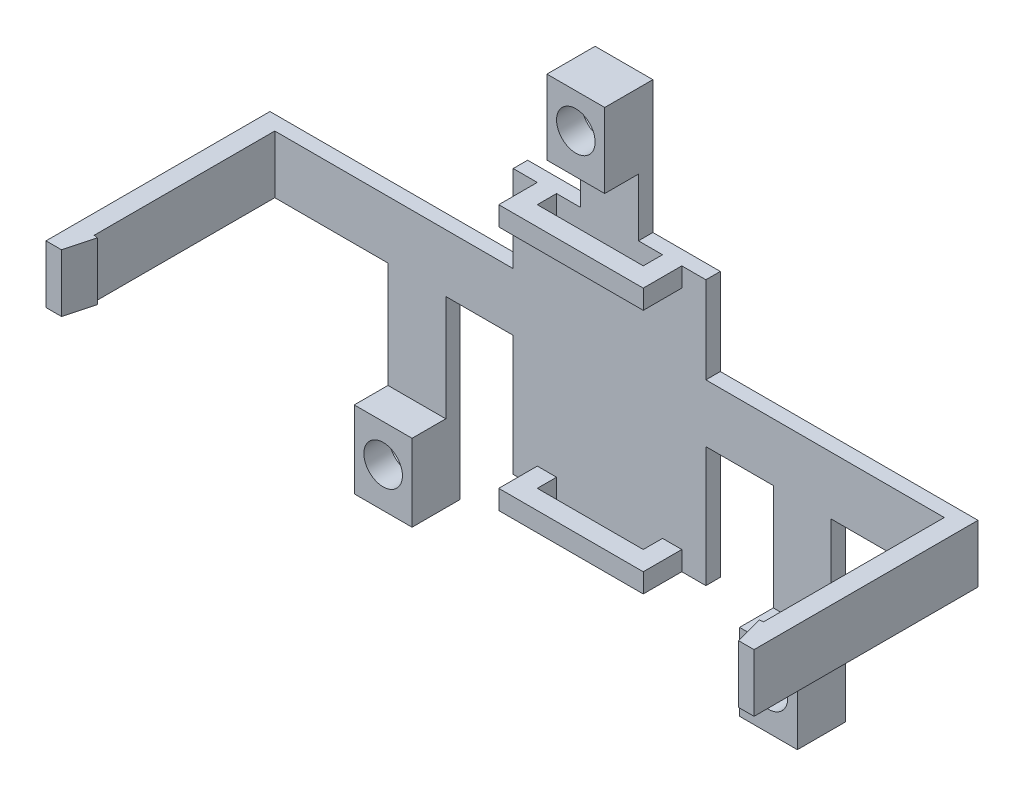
ISO-10303-21;
HEADER;
FILE_DESCRIPTION(('STEP AP214'),'2;1');
FILE_NAME('part.step','',(''),(''),'','','');
FILE_SCHEMA(('AUTOMOTIVE_DESIGN { 1 0 10303 214 1 1 1 1 }'));
ENDSEC;
DATA;
#1=APPLICATION_CONTEXT('core data for automotive mechanical design processes');
#2=APPLICATION_PROTOCOL_DEFINITION('international standard','automotive_design',2000,#1);
#3=PRODUCT_CONTEXT('',#1,'mechanical');
#4=PRODUCT('Part','Part','',(#3));
#5=PRODUCT_RELATED_PRODUCT_CATEGORY('part','',(#4));
#6=PRODUCT_DEFINITION_FORMATION('','',#4);
#7=PRODUCT_DEFINITION_CONTEXT('part definition',#1,'design');
#8=PRODUCT_DEFINITION('design','',#6,#7);
#9=PRODUCT_DEFINITION_SHAPE('','',#8);
#10=(LENGTH_UNIT() NAMED_UNIT(*) SI_UNIT(.MILLI.,.METRE.));
#11=(NAMED_UNIT(*) PLANE_ANGLE_UNIT() SI_UNIT($,.RADIAN.));
#12=(NAMED_UNIT(*) SI_UNIT($,.STERADIAN.) SOLID_ANGLE_UNIT());
#13=UNCERTAINTY_MEASURE_WITH_UNIT(LENGTH_MEASURE(1.E-05),#10,'distance_accuracy_value','');
#14=(GEOMETRIC_REPRESENTATION_CONTEXT(3) GLOBAL_UNCERTAINTY_ASSIGNED_CONTEXT((#13)) GLOBAL_UNIT_ASSIGNED_CONTEXT((#10,
#11,#12)) REPRESENTATION_CONTEXT('',''));
#15=CARTESIAN_POINT('',(0.,0.,0.));
#16=DIRECTION('',(0.,0.,1.));
#17=DIRECTION('',(1.,0.,0.));
#18=AXIS2_PLACEMENT_3D('',#15,#16,#17);
#19=CARTESIAN_POINT('',(0.,0.,3.));
#20=DIRECTION('',(0.,0.,1.));
#21=DIRECTION('',(1.,0.,0.));
#22=AXIS2_PLACEMENT_3D('',#19,#20,#21);
#23=PLANE('',#22);
#24=DIRECTION('',(-1.,0.,0.));
#25=VECTOR('',#24,1.);
#26=CARTESIAN_POINT('',(-53.5,30.,3.));
#27=LINE('',#26,#25);
#28=CARTESIAN_POINT('',(0.,30.,3.));
#29=VERTEX_POINT('',#28);
#30=CARTESIAN_POINT('',(-49.5,30.,3.));
#31=VERTEX_POINT('',#30);
#32=EDGE_CURVE('E58',#29,#31,#27,.T.);
#33=ORIENTED_EDGE('',*,*,#32,.T.);
#34=DIRECTION('',(0.,1.,0.));
#35=VECTOR('',#34,1.);
#36=CARTESIAN_POINT('',(-49.5,18.,3.));
#37=LINE('',#36,#35);
#38=CARTESIAN_POINT('',(-49.5,18.,3.));
#39=VERTEX_POINT('',#38);
#40=EDGE_CURVE('E53',#39,#31,#37,.T.);
#41=ORIENTED_EDGE('',*,*,#40,.F.);
#42=DIRECTION('',(1.,0.,0.));
#43=VECTOR('',#42,1.);
#44=CARTESIAN_POINT('',(-26.,18.,3.));
#45=LINE('',#44,#43);
#46=CARTESIAN_POINT('',(-26.,18.,3.));
#47=VERTEX_POINT('',#46);
#48=EDGE_CURVE('E733',#39,#47,#45,.T.);
#49=ORIENTED_EDGE('',*,*,#48,.T.);
#50=DIRECTION('',(0.,-1.,0.));
#51=VECTOR('',#50,1.);
#52=CARTESIAN_POINT('',(-26.,-4.,3.));
#53=LINE('',#52,#51);
#54=CARTESIAN_POINT('',(-26.,-4.,3.));
#55=VERTEX_POINT('',#54);
#56=EDGE_CURVE('E735',#47,#55,#53,.T.);
#57=ORIENTED_EDGE('',*,*,#56,.T.);
#58=DIRECTION('',(1.,0.,0.));
#59=VECTOR('',#58,1.);
#60=CARTESIAN_POINT('',(-26.,-4.,3.));
#61=LINE('',#60,#59);
#62=CARTESIAN_POINT('',(-14.,-4.,3.));
#63=VERTEX_POINT('',#62);
#64=EDGE_CURVE('E737',#55,#63,#61,.T.);
#65=ORIENTED_EDGE('',*,*,#64,.T.);
#66=DIRECTION('',(0.,1.,0.));
#67=VECTOR('',#66,1.);
#68=CARTESIAN_POINT('',(-14.,-4.,3.));
#69=LINE('',#68,#67);
#70=CARTESIAN_POINT('',(-14.,18.,3.));
#71=VERTEX_POINT('',#70);
#72=EDGE_CURVE('E739',#63,#71,#69,.T.);
#73=ORIENTED_EDGE('',*,*,#72,.T.);
#74=DIRECTION('',(1.,0.,0.));
#75=VECTOR('',#74,1.);
#76=CARTESIAN_POINT('',(0.,18.,3.));
#77=LINE('',#76,#75);
#78=CARTESIAN_POINT('',(0.,18.,3.));
#79=VERTEX_POINT('',#78);
#80=EDGE_CURVE('E741',#71,#79,#77,.T.);
#81=ORIENTED_EDGE('',*,*,#80,.T.);
#82=DIRECTION('',(0.,-1.,0.));
#83=VECTOR('',#82,1.);
#84=CARTESIAN_POINT('',(0.,0.,3.));
#85=LINE('',#84,#83);
#86=CARTESIAN_POINT('',(0.,-7.,3.));
#87=VERTEX_POINT('',#86);
#88=EDGE_CURVE('E701',#79,#87,#85,.T.);
#89=ORIENTED_EDGE('',*,*,#88,.T.);
#90=DIRECTION('',(1.,0.,0.));
#91=VECTOR('',#90,1.);
#92=CARTESIAN_POINT('',(0.,-7.,3.));
#93=LINE('',#92,#91);
#94=CARTESIAN_POINT('',(5.,-7.,3.));
#95=VERTEX_POINT('',#94);
#96=EDGE_CURVE('E706',#87,#95,#93,.T.);
#97=ORIENTED_EDGE('',*,*,#96,.T.);
#98=DIRECTION('',(0.,-1.,0.));
#99=VECTOR('',#98,1.);
#100=CARTESIAN_POINT('',(5.,-3.,3.));
#101=LINE('',#100,#99);
#102=CARTESIAN_POINT('',(5.,-3.,3.));
#103=VERTEX_POINT('',#102);
#104=EDGE_CURVE('E681',#103,#95,#101,.T.);
#105=ORIENTED_EDGE('',*,*,#104,.F.);
#106=DIRECTION('',(1.,0.,0.));
#107=VECTOR('',#106,1.);
#108=CARTESIAN_POINT('',(9.00000000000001,-3.,3.));
#109=LINE('',#108,#107);
#110=CARTESIAN_POINT('',(9.00000000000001,-3.,3.));
#111=VERTEX_POINT('',#110);
#112=EDGE_CURVE('E641',#103,#111,#109,.T.);
#113=ORIENTED_EDGE('',*,*,#112,.T.);
#114=DIRECTION('',(0.,-1.,0.));
#115=VECTOR('',#114,1.);
#116=CARTESIAN_POINT('',(9.00000000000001,-3.,3.));
#117=LINE('',#116,#115);
#118=CARTESIAN_POINT('',(9.00000000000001,-7.,3.));
#119=VERTEX_POINT('',#118);
#120=EDGE_CURVE('E664',#111,#119,#117,.T.);
#121=ORIENTED_EDGE('',*,*,#120,.T.);
#122=CARTESIAN_POINT('',(31.,-7.,3.));
#123=VERTEX_POINT('',#122);
#124=EDGE_CURVE('E709',#119,#123,#93,.T.);
#125=ORIENTED_EDGE('',*,*,#124,.T.);
#126=DIRECTION('',(0.,-1.,0.));
#127=VECTOR('',#126,1.);
#128=CARTESIAN_POINT('',(31.,-3.,3.));
#129=LINE('',#128,#127);
#130=CARTESIAN_POINT('',(31.,-3.,3.));
#131=VERTEX_POINT('',#130);
#132=EDGE_CURVE('E692',#131,#123,#129,.T.);
#133=ORIENTED_EDGE('',*,*,#132,.F.);
#134=DIRECTION('',(1.,0.,0.));
#135=VECTOR('',#134,1.);
#136=CARTESIAN_POINT('',(35.,-3.,3.));
#137=LINE('',#136,#135);
#138=CARTESIAN_POINT('',(35.,-3.,3.));
#139=VERTEX_POINT('',#138);
#140=EDGE_CURVE('E653',#131,#139,#137,.T.);
#141=ORIENTED_EDGE('',*,*,#140,.T.);
#142=DIRECTION('',(0.,-1.,0.));
#143=VECTOR('',#142,1.);
#144=CARTESIAN_POINT('',(35.,-3.,3.));
#145=LINE('',#144,#143);
#146=CARTESIAN_POINT('',(35.,-7.,3.));
#147=VERTEX_POINT('',#146);
#148=EDGE_CURVE('E689',#139,#147,#145,.T.);
#149=ORIENTED_EDGE('',*,*,#148,.T.);
#150=CARTESIAN_POINT('',(40.,-6.99999999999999,3.));
#151=VERTEX_POINT('',#150);
#152=EDGE_CURVE('E704',#147,#151,#93,.T.);
#153=ORIENTED_EDGE('',*,*,#152,.T.);
#154=DIRECTION('',(0.,1.,0.));
#155=VECTOR('',#154,1.);
#156=CARTESIAN_POINT('',(40.,0.,3.));
#157=LINE('',#156,#155);
#158=CARTESIAN_POINT('',(40.,18.,3.));
#159=VERTEX_POINT('',#158);
#160=EDGE_CURVE('E708',#151,#159,#157,.T.);
#161=ORIENTED_EDGE('',*,*,#160,.T.);
#162=DIRECTION('',(1.,0.,0.));
#163=VECTOR('',#162,1.);
#164=CARTESIAN_POINT('',(40.,18.,3.));
#165=LINE('',#164,#163);
#166=CARTESIAN_POINT('',(54.,18.,3.));
#167=VERTEX_POINT('',#166);
#168=EDGE_CURVE('E711',#159,#167,#165,.T.);
#169=ORIENTED_EDGE('',*,*,#168,.T.);
#170=DIRECTION('',(0.,-1.,0.));
#171=VECTOR('',#170,1.);
#172=CARTESIAN_POINT('',(54.,18.,3.));
#173=LINE('',#172,#171);
#174=CARTESIAN_POINT('',(54.,-4.,3.));
#175=VERTEX_POINT('',#174);
#176=EDGE_CURVE('E713',#167,#175,#173,.T.);
#177=ORIENTED_EDGE('',*,*,#176,.T.);
#178=DIRECTION('',(1.,0.,0.));
#179=VECTOR('',#178,1.);
#180=CARTESIAN_POINT('',(54.,-4.,3.));
#181=LINE('',#180,#179);
#182=CARTESIAN_POINT('',(66.,-4.,3.));
#183=VERTEX_POINT('',#182);
#184=EDGE_CURVE('E715',#175,#183,#181,.T.);
#185=ORIENTED_EDGE('',*,*,#184,.T.);
#186=DIRECTION('',(0.,1.,0.));
#187=VECTOR('',#186,1.);
#188=CARTESIAN_POINT('',(66.,18.,3.));
#189=LINE('',#188,#187);
#190=CARTESIAN_POINT('',(66.,18.,3.));
#191=VERTEX_POINT('',#190);
#192=EDGE_CURVE('E717',#183,#191,#189,.T.);
#193=ORIENTED_EDGE('',*,*,#192,.T.);
#194=DIRECTION('',(1.,0.,0.));
#195=VECTOR('',#194,1.);
#196=CARTESIAN_POINT('',(66.,18.,3.));
#197=LINE('',#196,#195);
#198=CARTESIAN_POINT('',(89.5,18.,3.));
#199=VERTEX_POINT('',#198);
#200=EDGE_CURVE('E719',#191,#199,#197,.T.);
#201=ORIENTED_EDGE('',*,*,#200,.T.);
#202=DIRECTION('',(0.,1.,0.));
#203=VECTOR('',#202,1.);
#204=CARTESIAN_POINT('',(89.5,18.,3.));
#205=LINE('',#204,#203);
#206=CARTESIAN_POINT('',(89.5,30.,3.));
#207=VERTEX_POINT('',#206);
#208=EDGE_CURVE('E431',#199,#207,#205,.T.);
#209=ORIENTED_EDGE('',*,*,#208,.T.);
#210=DIRECTION('',(-1.,0.,0.));
#211=VECTOR('',#210,1.);
#212=CARTESIAN_POINT('',(40.,30.,3.));
#213=LINE('',#212,#211);
#214=CARTESIAN_POINT('',(40.,30.,3.));
#215=VERTEX_POINT('',#214);
#216=EDGE_CURVE('E721',#207,#215,#213,.T.);
#217=ORIENTED_EDGE('',*,*,#216,.T.);
#218=DIRECTION('',(0.,1.,0.));
#219=VECTOR('',#218,1.);
#220=CARTESIAN_POINT('',(40.,30.,3.));
#221=LINE('',#220,#219);
#222=CARTESIAN_POINT('',(40.,48.,3.));
#223=VERTEX_POINT('',#222);
#224=EDGE_CURVE('E723',#215,#223,#221,.T.);
#225=ORIENTED_EDGE('',*,*,#224,.T.);
#226=DIRECTION('',(-1.,0.,0.));
#227=VECTOR('',#226,1.);
#228=CARTESIAN_POINT('',(0.,48.,3.));
#229=LINE('',#228,#227);
#230=CARTESIAN_POINT('',(35.,48.,3.));
#231=VERTEX_POINT('',#230);
#232=EDGE_CURVE('E726',#223,#231,#229,.T.);
#233=ORIENTED_EDGE('',*,*,#232,.T.);
#234=DIRECTION('',(0.,1.,0.));
#235=VECTOR('',#234,1.);
#236=CARTESIAN_POINT('',(35.,44.,3.));
#237=LINE('',#236,#235);
#238=CARTESIAN_POINT('',(35.,44.,3.));
#239=VERTEX_POINT('',#238);
#240=EDGE_CURVE('E635',#239,#231,#237,.T.);
#241=ORIENTED_EDGE('',*,*,#240,.F.);
#242=DIRECTION('',(-1.,0.,0.));
#243=VECTOR('',#242,1.);
#244=CARTESIAN_POINT('',(35.,44.,3.));
#245=LINE('',#244,#243);
#246=CARTESIAN_POINT('',(31.,44.,3.));
#247=VERTEX_POINT('',#246);
#248=EDGE_CURVE('E591',#239,#247,#245,.T.);
#249=ORIENTED_EDGE('',*,*,#248,.T.);
#250=DIRECTION('',(0.,1.,0.));
#251=VECTOR('',#250,1.);
#252=CARTESIAN_POINT('',(31.,44.,3.));
#253=LINE('',#252,#251);
#254=CARTESIAN_POINT('',(31.,48.,3.));
#255=VERTEX_POINT('',#254);
#256=EDGE_CURVE('E632',#247,#255,#253,.T.);
#257=ORIENTED_EDGE('',*,*,#256,.T.);
#258=CARTESIAN_POINT('',(26.,48.,3.));
#259=VERTEX_POINT('',#258);
#260=EDGE_CURVE('E729',#255,#259,#229,.T.);
#261=ORIENTED_EDGE('',*,*,#260,.T.);
#262=DIRECTION('',(0.,-1.,0.));
#263=VECTOR('',#262,1.);
#264=CARTESIAN_POINT('',(26.,48.,3.));
#265=LINE('',#264,#263);
#266=CARTESIAN_POINT('',(26.,60.,3.));
#267=VERTEX_POINT('',#266);
#268=EDGE_CURVE('E504',#267,#259,#265,.T.);
#269=ORIENTED_EDGE('',*,*,#268,.F.);
#270=DIRECTION('',(1.,0.,0.));
#271=VECTOR('',#270,1.);
#272=CARTESIAN_POINT('',(26.,60.,3.));
#273=LINE('',#272,#271);
#274=CARTESIAN_POINT('',(14.,60.,3.));
#275=VERTEX_POINT('',#274);
#276=EDGE_CURVE('E509',#275,#267,#273,.T.);
#277=ORIENTED_EDGE('',*,*,#276,.F.);
#278=DIRECTION('',(0.,1.,0.));
#279=VECTOR('',#278,1.);
#280=CARTESIAN_POINT('',(14.,48.,3.));
#281=LINE('',#280,#279);
#282=CARTESIAN_POINT('',(14.,48.,3.));
#283=VERTEX_POINT('',#282);
#284=EDGE_CURVE('E506',#283,#275,#281,.T.);
#285=ORIENTED_EDGE('',*,*,#284,.F.);
#286=CARTESIAN_POINT('',(8.99999999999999,48.,3.));
#287=VERTEX_POINT('',#286);
#288=EDGE_CURVE('E730',#283,#287,#229,.T.);
#289=ORIENTED_EDGE('',*,*,#288,.T.);
#290=DIRECTION('',(0.,1.,0.));
#291=VECTOR('',#290,1.);
#292=CARTESIAN_POINT('',(8.99999999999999,44.,3.));
#293=LINE('',#292,#291);
#294=CARTESIAN_POINT('',(8.99999999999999,44.,3.));
#295=VERTEX_POINT('',#294);
#296=EDGE_CURVE('E625',#295,#287,#293,.T.);
#297=ORIENTED_EDGE('',*,*,#296,.F.);
#298=DIRECTION('',(-1.,0.,0.));
#299=VECTOR('',#298,1.);
#300=CARTESIAN_POINT('',(4.99999999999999,44.,3.));
#301=LINE('',#300,#299);
#302=CARTESIAN_POINT('',(4.99999999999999,44.,3.));
#303=VERTEX_POINT('',#302);
#304=EDGE_CURVE('E602',#295,#303,#301,.T.);
#305=ORIENTED_EDGE('',*,*,#304,.T.);
#306=DIRECTION('',(0.,1.,0.));
#307=VECTOR('',#306,1.);
#308=CARTESIAN_POINT('',(4.99999999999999,44.,3.));
#309=LINE('',#308,#307);
#310=CARTESIAN_POINT('',(4.99999999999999,48.,3.));
#311=VERTEX_POINT('',#310);
#312=EDGE_CURVE('E621',#303,#311,#309,.T.);
#313=ORIENTED_EDGE('',*,*,#312,.T.);
#314=CARTESIAN_POINT('',(0.,48.,3.));
#315=VERTEX_POINT('',#314);
#316=EDGE_CURVE('E725',#311,#315,#229,.T.);
#317=ORIENTED_EDGE('',*,*,#316,.T.);
#318=DIRECTION('',(0.,-1.,0.));
#319=VECTOR('',#318,1.);
#320=CARTESIAN_POINT('',(0.,30.,3.));
#321=LINE('',#320,#319);
#322=EDGE_CURVE('E728',#315,#29,#321,.T.);
#323=ORIENTED_EDGE('',*,*,#322,.T.);
#324=EDGE_LOOP('',(#33,#41,#49,#57,#65,#73,#81,#89,#97,#105,#113,#121,#125,#133,#141,#149,#153,
#161,#169,#177,#185,#193,#201,#209,#217,#225,#233,#241,#249,#257,#261,#269,#277,#285,#289,#297,
#305,#313,#317,#323));
#325=FACE_BOUND('',#324,.T.);
#326=ADVANCED_FACE('F38',(#325),#23,.T.);
#327=CARTESIAN_POINT('',(-20.,-11.74,0.));
#328=DIRECTION('',(0.,0.,1.));
#329=DIRECTION('',(1.,0.,0.));
#330=AXIS2_PLACEMENT_3D('',#327,#328,#329);
#331=CYLINDRICAL_SURFACE('',#330,3.);
#332=CARTESIAN_POINT('',(-20.,-11.74,3.69999999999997));
#333=DIRECTION('',(0.,0.,1.));
#334=DIRECTION('',(1.,0.,0.));
#335=AXIS2_PLACEMENT_3D('',#332,#333,#334);
#336=CIRCLE('',#335,3.);
#337=CARTESIAN_POINT('',(-17.,-11.74,3.69999999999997));
#338=VERTEX_POINT('',#337);
#339=EDGE_CURVE('E46',#338,#338,#336,.T.);
#340=ORIENTED_EDGE('',*,*,#339,.T.);
#341=EDGE_LOOP('',(#340));
#342=FACE_BOUND('',#341,.T.);
#343=CARTESIAN_POINT('',(-20.,-11.74,0.));
#344=DIRECTION('',(0.,0.,1.));
#345=DIRECTION('',(1.,0.,0.));
#346=AXIS2_PLACEMENT_3D('',#343,#344,#345);
#347=CIRCLE('',#346,3.);
#348=CARTESIAN_POINT('',(-17.,-11.74,0.));
#349=VERTEX_POINT('',#348);
#350=EDGE_CURVE('E521',#349,#349,#347,.T.);
#351=ORIENTED_EDGE('',*,*,#350,.F.);
#352=EDGE_LOOP('',(#351));
#353=FACE_BOUND('',#352,.T.);
#354=ADVANCED_FACE('F834',(#342,#353),#331,.F.);
#355=CARTESIAN_POINT('',(60.,-11.74,0.));
#356=DIRECTION('',(0.,0.,1.));
#357=DIRECTION('',(1.,0.,0.));
#358=AXIS2_PLACEMENT_3D('',#355,#356,#357);
#359=CYLINDRICAL_SURFACE('',#358,2.99999999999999);
#360=CARTESIAN_POINT('',(60.,-11.74,3.70000000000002));
#361=DIRECTION('',(0.,0.,1.));
#362=DIRECTION('',(1.,0.,0.));
#363=AXIS2_PLACEMENT_3D('',#360,#361,#362);
#364=CIRCLE('',#363,2.99999999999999);
#365=CARTESIAN_POINT('',(63.,-11.74,3.70000000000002));
#366=VERTEX_POINT('',#365);
#367=EDGE_CURVE('E829',#366,#366,#364,.T.);
#368=ORIENTED_EDGE('',*,*,#367,.T.);
#369=EDGE_LOOP('',(#368));
#370=FACE_BOUND('',#369,.T.);
#371=CARTESIAN_POINT('',(60.,-11.74,0.));
#372=DIRECTION('',(0.,0.,1.));
#373=DIRECTION('',(-1.,0.,0.));
#374=AXIS2_PLACEMENT_3D('',#371,#372,#373);
#375=CIRCLE('',#374,2.99999999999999);
#376=CARTESIAN_POINT('',(57.,-11.74,0.));
#377=VERTEX_POINT('',#376);
#378=EDGE_CURVE('E519',#377,#377,#375,.T.);
#379=ORIENTED_EDGE('',*,*,#378,.F.);
#380=EDGE_LOOP('',(#379));
#381=FACE_BOUND('',#380,.T.);
#382=ADVANCED_FACE('F916',(#370,#381),#359,.F.);
#383=CARTESIAN_POINT('',(20.,68.26,0.));
#384=DIRECTION('',(0.,0.,1.));
#385=DIRECTION('',(1.,0.,0.));
#386=AXIS2_PLACEMENT_3D('',#383,#384,#385);
#387=CYLINDRICAL_SURFACE('',#386,3.);
#388=CARTESIAN_POINT('',(20.,68.26,3.69999999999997));
#389=DIRECTION('',(0.,0.,1.));
#390=DIRECTION('',(1.,0.,0.));
#391=AXIS2_PLACEMENT_3D('',#388,#389,#390);
#392=CIRCLE('',#391,3.);
#393=CARTESIAN_POINT('',(23.,68.26,3.69999999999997));
#394=VERTEX_POINT('',#393);
#395=EDGE_CURVE('E11',#394,#394,#392,.T.);
#396=ORIENTED_EDGE('',*,*,#395,.T.);
#397=EDGE_LOOP('',(#396));
#398=FACE_BOUND('',#397,.T.);
#399=CARTESIAN_POINT('',(20.,68.26,0.));
#400=DIRECTION('',(0.,0.,1.));
#401=DIRECTION('',(1.,0.,0.));
#402=AXIS2_PLACEMENT_3D('',#399,#400,#401);
#403=CIRCLE('',#402,3.);
#404=CARTESIAN_POINT('',(23.,68.26,0.));
#405=VERTEX_POINT('',#404);
#406=EDGE_CURVE('E459',#405,#405,#403,.T.);
#407=ORIENTED_EDGE('',*,*,#406,.F.);
#408=EDGE_LOOP('',(#407));
#409=FACE_BOUND('',#408,.T.);
#410=ADVANCED_FACE('F949',(#398,#409),#387,.F.);
#411=CARTESIAN_POINT('',(0.,48.,3.));
#412=DIRECTION('',(0.,-1.,0.));
#413=DIRECTION('',(1.,0.,0.));
#414=AXIS2_PLACEMENT_3D('',#411,#412,#413);
#415=PLANE('',#414);
#416=DIRECTION('',(0.,0.,-1.));
#417=VECTOR('',#416,1.);
#418=CARTESIAN_POINT('',(26.,48.,3.));
#419=LINE('',#418,#417);
#420=CARTESIAN_POINT('',(26.,48.,0.));
#421=VERTEX_POINT('',#420);
#422=EDGE_CURVE('E512',#259,#421,#419,.T.);
#423=ORIENTED_EDGE('',*,*,#422,.F.);
#424=ORIENTED_EDGE('',*,*,#260,.F.);
#425=DIRECTION('',(0.,0.,1.));
#426=VECTOR('',#425,1.);
#427=CARTESIAN_POINT('',(31.,48.,7.));
#428=LINE('',#427,#426);
#429=CARTESIAN_POINT('',(31.,48.,7.));
#430=VERTEX_POINT('',#429);
#431=EDGE_CURVE('E613',#255,#430,#428,.T.);
#432=ORIENTED_EDGE('',*,*,#431,.T.);
#433=DIRECTION('',(-1.,0.,0.));
#434=VECTOR('',#433,1.);
#435=CARTESIAN_POINT('',(8.99999999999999,48.,7.));
#436=LINE('',#435,#434);
#437=CARTESIAN_POINT('',(8.99999999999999,48.,7.));
#438=VERTEX_POINT('',#437);
#439=EDGE_CURVE('E616',#430,#438,#436,.T.);
#440=ORIENTED_EDGE('',*,*,#439,.T.);
#441=DIRECTION('',(0.,0.,-1.));
#442=VECTOR('',#441,1.);
#443=CARTESIAN_POINT('',(8.99999999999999,48.,3.));
#444=LINE('',#443,#442);
#445=EDGE_CURVE('E585',#438,#287,#444,.T.);
#446=ORIENTED_EDGE('',*,*,#445,.T.);
#447=ORIENTED_EDGE('',*,*,#288,.F.);
#448=DIRECTION('',(0.,0.,-1.));
#449=VECTOR('',#448,1.);
#450=CARTESIAN_POINT('',(14.,48.,3.));
#451=LINE('',#450,#449);
#452=CARTESIAN_POINT('',(14.,48.,0.));
#453=VERTEX_POINT('',#452);
#454=EDGE_CURVE('E516',#283,#453,#451,.T.);
#455=ORIENTED_EDGE('',*,*,#454,.T.);
#456=DIRECTION('',(-1.,0.,0.));
#457=VECTOR('',#456,1.);
#458=CARTESIAN_POINT('',(0.,48.,0.));
#459=LINE('',#458,#457);
#460=CARTESIAN_POINT('',(0.,48.,0.));
#461=VERTEX_POINT('',#460);
#462=EDGE_CURVE('E763',#453,#461,#459,.T.);
#463=ORIENTED_EDGE('',*,*,#462,.T.);
#464=DIRECTION('',(0.,0.,-1.));
#465=VECTOR('',#464,1.);
#466=CARTESIAN_POINT('',(0.,48.,3.));
#467=LINE('',#466,#465);
#468=EDGE_CURVE('E799',#315,#461,#467,.T.);
#469=ORIENTED_EDGE('',*,*,#468,.F.);
#470=ORIENTED_EDGE('',*,*,#316,.F.);
#471=DIRECTION('',(0.,0.,1.));
#472=VECTOR('',#471,1.);
#473=CARTESIAN_POINT('',(4.99999999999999,48.,3.));
#474=LINE('',#473,#472);
#475=CARTESIAN_POINT('',(4.99999999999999,48.,11.));
#476=VERTEX_POINT('',#475);
#477=EDGE_CURVE('E572',#311,#476,#474,.T.);
#478=ORIENTED_EDGE('',*,*,#477,.T.);
#479=DIRECTION('',(1.,0.,0.));
#480=VECTOR('',#479,1.);
#481=CARTESIAN_POINT('',(4.99999999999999,48.,11.));
#482=LINE('',#481,#480);
#483=CARTESIAN_POINT('',(35.,48.,11.));
#484=VERTEX_POINT('',#483);
#485=EDGE_CURVE('E607',#476,#484,#482,.T.);
#486=ORIENTED_EDGE('',*,*,#485,.T.);
#487=DIRECTION('',(0.,0.,-1.));
#488=VECTOR('',#487,1.);
#489=CARTESIAN_POINT('',(35.,48.,11.));
#490=LINE('',#489,#488);
#491=EDGE_CURVE('E610',#484,#231,#490,.T.);
#492=ORIENTED_EDGE('',*,*,#491,.T.);
#493=ORIENTED_EDGE('',*,*,#232,.F.);
#494=DIRECTION('',(0.,0.,-1.));
#495=VECTOR('',#494,1.);
#496=CARTESIAN_POINT('',(40.,48.,3.));
#497=LINE('',#496,#495);
#498=CARTESIAN_POINT('',(40.,48.,0.));
#499=VERTEX_POINT('',#498);
#500=EDGE_CURVE('E802',#223,#499,#497,.T.);
#501=ORIENTED_EDGE('',*,*,#500,.T.);
#502=EDGE_CURVE('E764',#499,#421,#459,.T.);
#503=ORIENTED_EDGE('',*,*,#502,.T.);
#504=EDGE_LOOP('',(#423,#424,#432,#440,#446,#447,#455,#463,#469,#470,#478,#486,#492,#493,#501,#503));
#505=FACE_BOUND('',#504,.T.);
#506=ADVANCED_FACE('F945',(#505),#415,.F.);
#507=CARTESIAN_POINT('',(0.,-7.,3.));
#508=DIRECTION('',(0.,1.,0.));
#509=DIRECTION('',(-1.,0.,0.));
#510=AXIS2_PLACEMENT_3D('',#507,#508,#509);
#511=PLANE('',#510);
#512=ORIENTED_EDGE('',*,*,#152,.F.);
#513=DIRECTION('',(0.,0.,1.));
#514=VECTOR('',#513,1.);
#515=CARTESIAN_POINT('',(35.,-7.,11.));
#516=LINE('',#515,#514);
#517=CARTESIAN_POINT('',(35.,-7.,11.));
#518=VERTEX_POINT('',#517);
#519=EDGE_CURVE('E673',#147,#518,#516,.T.);
#520=ORIENTED_EDGE('',*,*,#519,.T.);
#521=DIRECTION('',(-1.,0.,0.));
#522=VECTOR('',#521,1.);
#523=CARTESIAN_POINT('',(5.,-7.,11.));
#524=LINE('',#523,#522);
#525=CARTESIAN_POINT('',(5.,-7.,11.));
#526=VERTEX_POINT('',#525);
#527=EDGE_CURVE('E676',#518,#526,#524,.T.);
#528=ORIENTED_EDGE('',*,*,#527,.T.);
#529=DIRECTION('',(0.,0.,-1.));
#530=VECTOR('',#529,1.);
#531=CARTESIAN_POINT('',(5.,-7.,3.));
#532=LINE('',#531,#530);
#533=EDGE_CURVE('E644',#526,#95,#532,.T.);
#534=ORIENTED_EDGE('',*,*,#533,.T.);
#535=ORIENTED_EDGE('',*,*,#96,.F.);
#536=DIRECTION('',(0.,0.,-1.));
#537=VECTOR('',#536,1.);
#538=CARTESIAN_POINT('',(0.,-7.,3.));
#539=LINE('',#538,#537);
#540=CARTESIAN_POINT('',(0.,-7.,0.));
#541=VERTEX_POINT('',#540);
#542=EDGE_CURVE('E826',#87,#541,#539,.T.);
#543=ORIENTED_EDGE('',*,*,#542,.T.);
#544=DIRECTION('',(1.,0.,0.));
#545=VECTOR('',#544,1.);
#546=CARTESIAN_POINT('',(0.,-7.,0.));
#547=LINE('',#546,#545);
#548=CARTESIAN_POINT('',(40.,-6.99999999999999,0.));
#549=VERTEX_POINT('',#548);
#550=EDGE_CURVE('E684',#541,#549,#547,.T.);
#551=ORIENTED_EDGE('',*,*,#550,.T.);
#552=DIRECTION('',(0.,0.,-1.));
#553=VECTOR('',#552,1.);
#554=CARTESIAN_POINT('',(40.,-6.99999999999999,3.));
#555=LINE('',#554,#553);
#556=EDGE_CURVE('E823',#151,#549,#555,.T.);
#557=ORIENTED_EDGE('',*,*,#556,.F.);
#558=EDGE_LOOP('',(#512,#520,#528,#534,#535,#543,#551,#557));
#559=FACE_BOUND('',#558,.T.);
#560=DIRECTION('',(0.,0.,-1.));
#561=VECTOR('',#560,1.);
#562=CARTESIAN_POINT('',(31.,-7.,3.));
#563=LINE('',#562,#561);
#564=CARTESIAN_POINT('',(31.,-7.,7.));
#565=VERTEX_POINT('',#564);
#566=EDGE_CURVE('E670',#565,#123,#563,.T.);
#567=ORIENTED_EDGE('',*,*,#566,.T.);
#568=ORIENTED_EDGE('',*,*,#124,.F.);
#569=DIRECTION('',(0.,0.,1.));
#570=VECTOR('',#569,1.);
#571=CARTESIAN_POINT('',(9.,-7.,7.));
#572=LINE('',#571,#570);
#573=CARTESIAN_POINT('',(9.,-7.,7.));
#574=VERTEX_POINT('',#573);
#575=EDGE_CURVE('E624',#119,#574,#572,.T.);
#576=ORIENTED_EDGE('',*,*,#575,.T.);
#577=DIRECTION('',(1.,0.,0.));
#578=VECTOR('',#577,1.);
#579=CARTESIAN_POINT('',(31.,-7.,7.));
#580=LINE('',#579,#578);
#581=EDGE_CURVE('E667',#574,#565,#580,.T.);
#582=ORIENTED_EDGE('',*,*,#581,.T.);
#583=EDGE_LOOP('',(#567,#568,#576,#582));
#584=FACE_BOUND('',#583,.T.);
#585=ADVANCED_FACE('F948',(#559,#584),#511,.F.);
#586=CARTESIAN_POINT('',(40.,0.,3.));
#587=DIRECTION('',(-1.,0.,0.));
#588=DIRECTION('',(0.,-1.,0.));
#589=AXIS2_PLACEMENT_3D('',#586,#587,#588);
#590=PLANE('',#589);
#591=DIRECTION('',(0.,1.,0.));
#592=VECTOR('',#591,1.);
#593=CARTESIAN_POINT('',(40.,0.,0.));
#594=LINE('',#593,#592);
#595=CARTESIAN_POINT('',(40.,18.,0.));
#596=VERTEX_POINT('',#595);
#597=EDGE_CURVE('E747',#549,#596,#594,.T.);
#598=ORIENTED_EDGE('',*,*,#597,.T.);
#599=DIRECTION('',(0.,0.,-1.));
#600=VECTOR('',#599,1.);
#601=CARTESIAN_POINT('',(40.,18.,3.));
#602=LINE('',#601,#600);
#603=EDGE_CURVE('E820',#159,#596,#602,.T.);
#604=ORIENTED_EDGE('',*,*,#603,.F.);
#605=ORIENTED_EDGE('',*,*,#160,.F.);
#606=ORIENTED_EDGE('',*,*,#556,.T.);
#607=EDGE_LOOP('',(#598,#604,#605,#606));
#608=FACE_BOUND('',#607,.T.);
#609=ADVANCED_FACE('F977',(#608),#590,.F.);
#610=CARTESIAN_POINT('',(40.,18.,3.));
#611=DIRECTION('',(0.,1.,0.));
#612=DIRECTION('',(-1.,0.,0.));
#613=AXIS2_PLACEMENT_3D('',#610,#611,#612);
#614=PLANE('',#613);
#615=DIRECTION('',(1.,0.,0.));
#616=VECTOR('',#615,1.);
#617=CARTESIAN_POINT('',(40.,18.,0.));
#618=LINE('',#617,#616);
#619=CARTESIAN_POINT('',(54.,18.,0.));
#620=VERTEX_POINT('',#619);
#621=EDGE_CURVE('E749',#596,#620,#618,.T.);
#622=ORIENTED_EDGE('',*,*,#621,.T.);
#623=DIRECTION('',(0.,0.,-1.));
#624=VECTOR('',#623,1.);
#625=CARTESIAN_POINT('',(54.,18.,3.));
#626=LINE('',#625,#624);
#627=EDGE_CURVE('E817',#167,#620,#626,.T.);
#628=ORIENTED_EDGE('',*,*,#627,.F.);
#629=ORIENTED_EDGE('',*,*,#168,.F.);
#630=ORIENTED_EDGE('',*,*,#603,.T.);
#631=EDGE_LOOP('',(#622,#628,#629,#630));
#632=FACE_BOUND('',#631,.T.);
#633=ADVANCED_FACE('F973',(#632),#614,.F.);
#634=CARTESIAN_POINT('',(54.,18.,3.));
#635=DIRECTION('',(1.,0.,0.));
#636=DIRECTION('',(0.,0.,-1.));
#637=AXIS2_PLACEMENT_3D('',#634,#635,#636);
#638=PLANE('',#637);
#639=DIRECTION('',(0.,-1.,0.));
#640=VECTOR('',#639,1.);
#641=CARTESIAN_POINT('',(54.,18.,0.));
#642=LINE('',#641,#640);
#643=CARTESIAN_POINT('',(54.,-20.,0.));
#644=VERTEX_POINT('',#643);
#645=EDGE_CURVE('E751',#620,#644,#642,.T.);
#646=ORIENTED_EDGE('',*,*,#645,.T.);
#647=DIRECTION('',(0.,0.,-1.));
#648=VECTOR('',#647,1.);
#649=CARTESIAN_POINT('',(54.,-20.,10.));
#650=LINE('',#649,#648);
#651=CARTESIAN_POINT('',(54.,-20.,10.));
#652=VERTEX_POINT('',#651);
#653=EDGE_CURVE('E576',#652,#644,#650,.T.);
#654=ORIENTED_EDGE('',*,*,#653,.F.);
#655=DIRECTION('',(0.,1.,0.));
#656=VECTOR('',#655,1.);
#657=CARTESIAN_POINT('',(54.,-4.,10.));
#658=LINE('',#657,#656);
#659=CARTESIAN_POINT('',(54.,-4.,10.));
#660=VERTEX_POINT('',#659);
#661=EDGE_CURVE('E560',#652,#660,#658,.T.);
#662=ORIENTED_EDGE('',*,*,#661,.T.);
#663=DIRECTION('',(0.,0.,-1.));
#664=VECTOR('',#663,1.);
#665=CARTESIAN_POINT('',(54.,-4.,10.));
#666=LINE('',#665,#664);
#667=EDGE_CURVE('E573',#660,#175,#666,.T.);
#668=ORIENTED_EDGE('',*,*,#667,.T.);
#669=ORIENTED_EDGE('',*,*,#176,.F.);
#670=ORIENTED_EDGE('',*,*,#627,.T.);
#671=EDGE_LOOP('',(#646,#654,#662,#668,#669,#670));
#672=FACE_BOUND('',#671,.T.);
#673=ADVANCED_FACE('F969',(#672),#638,.F.);
#674=CARTESIAN_POINT('',(66.,18.,3.));
#675=DIRECTION('',(-1.,0.,0.));
#676=DIRECTION('',(0.,0.,1.));
#677=AXIS2_PLACEMENT_3D('',#674,#675,#676);
#678=PLANE('',#677);
#679=DIRECTION('',(0.,1.,0.));
#680=VECTOR('',#679,1.);
#681=CARTESIAN_POINT('',(66.,18.,0.));
#682=LINE('',#681,#680);
#683=CARTESIAN_POINT('',(66.,-20.,0.));
#684=VERTEX_POINT('',#683);
#685=CARTESIAN_POINT('',(66.,18.,0.));
#686=VERTEX_POINT('',#685);
#687=EDGE_CURVE('E753',#684,#686,#682,.T.);
#688=ORIENTED_EDGE('',*,*,#687,.T.);
#689=DIRECTION('',(0.,0.,-1.));
#690=VECTOR('',#689,1.);
#691=CARTESIAN_POINT('',(66.,18.,3.));
#692=LINE('',#691,#690);
#693=EDGE_CURVE('E814',#191,#686,#692,.T.);
#694=ORIENTED_EDGE('',*,*,#693,.F.);
#695=ORIENTED_EDGE('',*,*,#192,.F.);
#696=DIRECTION('',(0.,0.,-1.));
#697=VECTOR('',#696,1.);
#698=CARTESIAN_POINT('',(66.,-4.,10.));
#699=LINE('',#698,#697);
#700=CARTESIAN_POINT('',(66.,-4.,10.));
#701=VERTEX_POINT('',#700);
#702=EDGE_CURVE('E569',#701,#183,#699,.T.);
#703=ORIENTED_EDGE('',*,*,#702,.F.);
#704=DIRECTION('',(0.,-1.,0.));
#705=VECTOR('',#704,1.);
#706=CARTESIAN_POINT('',(66.,-4.,10.));
#707=LINE('',#706,#705);
#708=CARTESIAN_POINT('',(66.,-20.,10.));
#709=VERTEX_POINT('',#708);
#710=EDGE_CURVE('E554',#701,#709,#707,.T.);
#711=ORIENTED_EDGE('',*,*,#710,.T.);
#712=DIRECTION('',(0.,0.,-1.));
#713=VECTOR('',#712,1.);
#714=CARTESIAN_POINT('',(66.,-20.,10.));
#715=LINE('',#714,#713);
#716=EDGE_CURVE('E566',#709,#684,#715,.T.);
#717=ORIENTED_EDGE('',*,*,#716,.T.);
#718=EDGE_LOOP('',(#688,#694,#695,#703,#711,#717));
#719=FACE_BOUND('',#718,.T.);
#720=ADVANCED_FACE('F965',(#719),#678,.F.);
#721=CARTESIAN_POINT('',(66.,18.,3.));
#722=DIRECTION('',(0.,1.,0.));
#723=DIRECTION('',(-1.,0.,0.));
#724=AXIS2_PLACEMENT_3D('',#721,#722,#723);
#725=PLANE('',#724);
#726=DIRECTION('',(1.,0.,0.));
#727=VECTOR('',#726,1.);
#728=CARTESIAN_POINT('',(66.,18.,0.));
#729=LINE('',#728,#727);
#730=CARTESIAN_POINT('',(93.5,18.,0.));
#731=VERTEX_POINT('',#730);
#732=EDGE_CURVE('E755',#686,#731,#729,.T.);
#733=ORIENTED_EDGE('',*,*,#732,.T.);
#734=DIRECTION('',(0.,0.,-1.));
#735=VECTOR('',#734,1.);
#736=CARTESIAN_POINT('',(93.5,18.,3.));
#737=LINE('',#736,#735);
#738=CARTESIAN_POINT('',(93.5,18.,46.5));
#739=VERTEX_POINT('',#738);
#740=EDGE_CURVE('E811',#739,#731,#737,.T.);
#741=ORIENTED_EDGE('',*,*,#740,.F.);
#742=DIRECTION('',(-1.,0.,0.));
#743=VECTOR('',#742,1.);
#744=CARTESIAN_POINT('',(90.269897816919,18.,46.5));
#745=LINE('',#744,#743);
#746=CARTESIAN_POINT('',(90.269897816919,18.,46.5));
#747=VERTEX_POINT('',#746);
#748=EDGE_CURVE('E422',#739,#747,#745,.T.);
#749=ORIENTED_EDGE('',*,*,#748,.T.);
#750=DIRECTION('',(-0.258819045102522,0.,-0.965925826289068));
#751=VECTOR('',#750,1.);
#752=CARTESIAN_POINT('',(88.7,18.,40.6410615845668));
#753=LINE('',#752,#751);
#754=CARTESIAN_POINT('',(88.7,18.,40.6410615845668));
#755=VERTEX_POINT('',#754);
#756=EDGE_CURVE('E434',#747,#755,#753,.T.);
#757=ORIENTED_EDGE('',*,*,#756,.T.);
#758=DIRECTION('',(0.984807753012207,0.,-0.173648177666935));
#759=VECTOR('',#758,1.);
#760=CARTESIAN_POINT('',(89.5,18.,40.5));
#761=LINE('',#760,#759);
#762=CARTESIAN_POINT('',(89.5,18.,40.5));
#763=VERTEX_POINT('',#762);
#764=EDGE_CURVE('E437',#755,#763,#761,.T.);
#765=ORIENTED_EDGE('',*,*,#764,.T.);
#766=DIRECTION('',(0.,0.,-1.));
#767=VECTOR('',#766,1.);
#768=CARTESIAN_POINT('',(89.5,18.,40.5));
#769=LINE('',#768,#767);
#770=EDGE_CURVE('E448',#763,#199,#769,.T.);
#771=ORIENTED_EDGE('',*,*,#770,.T.);
#772=ORIENTED_EDGE('',*,*,#200,.F.);
#773=ORIENTED_EDGE('',*,*,#693,.T.);
#774=EDGE_LOOP('',(#733,#741,#749,#757,#765,#771,#772,#773));
#775=FACE_BOUND('',#774,.T.);
#776=ADVANCED_FACE('F961',(#775),#725,.F.);
#777=CARTESIAN_POINT('',(93.5,18.,3.));
#778=DIRECTION('',(-1.,0.,0.));
#779=DIRECTION('',(0.,0.,1.));
#780=AXIS2_PLACEMENT_3D('',#777,#778,#779);
#781=PLANE('',#780);
#782=DIRECTION('',(0.,1.,0.));
#783=VECTOR('',#782,1.);
#784=CARTESIAN_POINT('',(93.5,18.,0.));
#785=LINE('',#784,#783);
#786=CARTESIAN_POINT('',(93.5,30.,0.));
#787=VERTEX_POINT('',#786);
#788=EDGE_CURVE('E757',#731,#787,#785,.T.);
#789=ORIENTED_EDGE('',*,*,#788,.T.);
#790=DIRECTION('',(0.,0.,-1.));
#791=VECTOR('',#790,1.);
#792=CARTESIAN_POINT('',(93.5,30.,3.));
#793=LINE('',#792,#791);
#794=CARTESIAN_POINT('',(93.5,30.,46.5));
#795=VERTEX_POINT('',#794);
#796=EDGE_CURVE('E808',#795,#787,#793,.T.);
#797=ORIENTED_EDGE('',*,*,#796,.F.);
#798=DIRECTION('',(0.,-1.,0.));
#799=VECTOR('',#798,1.);
#800=CARTESIAN_POINT('',(93.5,37.6837490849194,46.5));
#801=LINE('',#800,#799);
#802=EDGE_CURVE('E439',#795,#739,#801,.T.);
#803=ORIENTED_EDGE('',*,*,#802,.T.);
#804=ORIENTED_EDGE('',*,*,#740,.T.);
#805=EDGE_LOOP('',(#789,#797,#803,#804));
#806=FACE_BOUND('',#805,.T.);
#807=ADVANCED_FACE('F957',(#806),#781,.F.);
#808=CARTESIAN_POINT('',(40.,30.,3.));
#809=DIRECTION('',(0.,-1.,0.));
#810=DIRECTION('',(1.,0.,0.));
#811=AXIS2_PLACEMENT_3D('',#808,#809,#810);
#812=PLANE('',#811);
#813=DIRECTION('',(-1.,0.,0.));
#814=VECTOR('',#813,1.);
#815=CARTESIAN_POINT('',(40.,30.,0.));
#816=LINE('',#815,#814);
#817=CARTESIAN_POINT('',(40.,30.,0.));
#818=VERTEX_POINT('',#817);
#819=EDGE_CURVE('E759',#787,#818,#816,.T.);
#820=ORIENTED_EDGE('',*,*,#819,.T.);
#821=DIRECTION('',(0.,0.,-1.));
#822=VECTOR('',#821,1.);
#823=CARTESIAN_POINT('',(40.,30.,3.));
#824=LINE('',#823,#822);
#825=EDGE_CURVE('E805',#215,#818,#824,.T.);
#826=ORIENTED_EDGE('',*,*,#825,.F.);
#827=ORIENTED_EDGE('',*,*,#216,.F.);
#828=DIRECTION('',(0.,0.,-1.));
#829=VECTOR('',#828,1.);
#830=CARTESIAN_POINT('',(89.5,30.,40.5));
#831=LINE('',#830,#829);
#832=CARTESIAN_POINT('',(89.5,30.,40.5));
#833=VERTEX_POINT('',#832);
#834=EDGE_CURVE('E452',#833,#207,#831,.T.);
#835=ORIENTED_EDGE('',*,*,#834,.F.);
#836=DIRECTION('',(-0.984807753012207,0.,0.173648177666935));
#837=VECTOR('',#836,1.);
#838=CARTESIAN_POINT('',(89.5,30.,40.5));
#839=LINE('',#838,#837);
#840=CARTESIAN_POINT('',(88.7,30.,40.6410615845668));
#841=VERTEX_POINT('',#840);
#842=EDGE_CURVE('E429',#833,#841,#839,.T.);
#843=ORIENTED_EDGE('',*,*,#842,.T.);
#844=DIRECTION('',(0.258819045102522,0.,0.965925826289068));
#845=VECTOR('',#844,1.);
#846=CARTESIAN_POINT('',(88.7,30.,40.6410615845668));
#847=LINE('',#846,#845);
#848=CARTESIAN_POINT('',(90.269897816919,30.,46.5));
#849=VERTEX_POINT('',#848);
#850=EDGE_CURVE('E426',#841,#849,#847,.T.);
#851=ORIENTED_EDGE('',*,*,#850,.T.);
#852=DIRECTION('',(1.,0.,0.));
#853=VECTOR('',#852,1.);
#854=CARTESIAN_POINT('',(90.269897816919,30.,46.5));
#855=LINE('',#854,#853);
#856=EDGE_CURVE('E423',#849,#795,#855,.T.);
#857=ORIENTED_EDGE('',*,*,#856,.T.);
#858=ORIENTED_EDGE('',*,*,#796,.T.);
#859=EDGE_LOOP('',(#820,#826,#827,#835,#843,#851,#857,#858));
#860=FACE_BOUND('',#859,.T.);
#861=ADVANCED_FACE('F953',(#860),#812,.F.);
#862=CARTESIAN_POINT('',(40.,30.,3.));
#863=DIRECTION('',(-1.,0.,0.));
#864=DIRECTION('',(0.,-1.,0.));
#865=AXIS2_PLACEMENT_3D('',#862,#863,#864);
#866=PLANE('',#865);
#867=DIRECTION('',(0.,1.,0.));
#868=VECTOR('',#867,1.);
#869=CARTESIAN_POINT('',(40.,30.,0.));
#870=LINE('',#869,#868);
#871=EDGE_CURVE('E761',#818,#499,#870,.T.);
#872=ORIENTED_EDGE('',*,*,#871,.T.);
#873=ORIENTED_EDGE('',*,*,#500,.F.);
#874=ORIENTED_EDGE('',*,*,#224,.F.);
#875=ORIENTED_EDGE('',*,*,#825,.T.);
#876=EDGE_LOOP('',(#872,#873,#874,#875));
#877=FACE_BOUND('',#876,.T.);
#878=ADVANCED_FACE('F943',(#877),#866,.F.);
#879=CARTESIAN_POINT('',(0.,30.,3.));
#880=DIRECTION('',(1.,0.,0.));
#881=DIRECTION('',(0.,1.,0.));
#882=AXIS2_PLACEMENT_3D('',#879,#880,#881);
#883=PLANE('',#882);
#884=DIRECTION('',(0.,-1.,0.));
#885=VECTOR('',#884,1.);
#886=CARTESIAN_POINT('',(0.,30.,0.));
#887=LINE('',#886,#885);
#888=CARTESIAN_POINT('',(0.,30.,0.));
#889=VERTEX_POINT('',#888);
#890=EDGE_CURVE('E767',#461,#889,#887,.T.);
#891=ORIENTED_EDGE('',*,*,#890,.T.);
#892=DIRECTION('',(0.,0.,-1.));
#893=VECTOR('',#892,1.);
#894=CARTESIAN_POINT('',(0.,30.,3.));
#895=LINE('',#894,#893);
#896=EDGE_CURVE('E796',#29,#889,#895,.T.);
#897=ORIENTED_EDGE('',*,*,#896,.F.);
#898=ORIENTED_EDGE('',*,*,#322,.F.);
#899=ORIENTED_EDGE('',*,*,#468,.T.);
#900=EDGE_LOOP('',(#891,#897,#898,#899));
#901=FACE_BOUND('',#900,.T.);
#902=ADVANCED_FACE('F940',(#901),#883,.F.);
#903=CARTESIAN_POINT('',(-53.5,30.,3.));
#904=DIRECTION('',(0.,-1.,0.));
#905=DIRECTION('',(0.,0.,-1.));
#906=AXIS2_PLACEMENT_3D('',#903,#904,#905);
#907=PLANE('',#906);
#908=DIRECTION('',(-1.,0.,0.));
#909=VECTOR('',#908,1.);
#910=CARTESIAN_POINT('',(-53.5,30.,0.));
#911=LINE('',#910,#909);
#912=CARTESIAN_POINT('',(-53.5,30.,0.));
#913=VERTEX_POINT('',#912);
#914=EDGE_CURVE('E769',#889,#913,#911,.T.);
#915=ORIENTED_EDGE('',*,*,#914,.T.);
#916=DIRECTION('',(0.,0.,-1.));
#917=VECTOR('',#916,1.);
#918=CARTESIAN_POINT('',(-53.5,30.,3.));
#919=LINE('',#918,#917);
#920=CARTESIAN_POINT('',(-53.5,29.9999999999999,46.5));
#921=VERTEX_POINT('',#920);
#922=EDGE_CURVE('E793',#921,#913,#919,.T.);
#923=ORIENTED_EDGE('',*,*,#922,.F.);
#924=DIRECTION('',(-1.,0.,0.));
#925=VECTOR('',#924,1.);
#926=CARTESIAN_POINT('',(-50.269897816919,29.9999999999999,46.5));
#927=LINE('',#926,#925);
#928=CARTESIAN_POINT('',(-50.269897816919,29.9999999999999,46.5));
#929=VERTEX_POINT('',#928);
#930=EDGE_CURVE('E405',#929,#921,#927,.T.);
#931=ORIENTED_EDGE('',*,*,#930,.F.);
#932=DIRECTION('',(-0.258819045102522,0.,0.965925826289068));
#933=VECTOR('',#932,1.);
#934=CARTESIAN_POINT('',(-48.7,29.9999999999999,40.6410615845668));
#935=LINE('',#934,#933);
#936=CARTESIAN_POINT('',(-48.7,29.9999999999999,40.6410615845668));
#937=VERTEX_POINT('',#936);
#938=EDGE_CURVE('E414',#937,#929,#935,.T.);
#939=ORIENTED_EDGE('',*,*,#938,.F.);
#940=DIRECTION('',(0.984807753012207,0.,0.173648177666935));
#941=VECTOR('',#940,1.);
#942=CARTESIAN_POINT('',(-49.5,29.9999999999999,40.5));
#943=LINE('',#942,#941);
#944=CARTESIAN_POINT('',(-49.5,29.9999999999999,40.5));
#945=VERTEX_POINT('',#944);
#946=EDGE_CURVE('E385',#945,#937,#943,.T.);
#947=ORIENTED_EDGE('',*,*,#946,.F.);
#948=DIRECTION('',(0.,0.,-1.));
#949=VECTOR('',#948,1.);
#950=CARTESIAN_POINT('',(-49.5,29.9999999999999,40.5));
#951=LINE('',#950,#949);
#952=EDGE_CURVE('E417',#945,#31,#951,.T.);
#953=ORIENTED_EDGE('',*,*,#952,.T.);
#954=ORIENTED_EDGE('',*,*,#32,.F.);
#955=ORIENTED_EDGE('',*,*,#896,.T.);
#956=EDGE_LOOP('',(#915,#923,#931,#939,#947,#953,#954,#955));
#957=FACE_BOUND('',#956,.T.);
#958=ADVANCED_FACE('F896',(#957),#907,.F.);
#959=CARTESIAN_POINT('',(-53.5,30.,3.));
#960=DIRECTION('',(1.,0.,0.));
#961=DIRECTION('',(0.,1.,0.));
#962=AXIS2_PLACEMENT_3D('',#959,#960,#961);
#963=PLANE('',#962);
#964=DIRECTION('',(0.,-1.,0.));
#965=VECTOR('',#964,1.);
#966=CARTESIAN_POINT('',(-53.5,30.,0.));
#967=LINE('',#966,#965);
#968=CARTESIAN_POINT('',(-53.5,18.,0.));
#969=VERTEX_POINT('',#968);
#970=EDGE_CURVE('E771',#913,#969,#967,.T.);
#971=ORIENTED_EDGE('',*,*,#970,.T.);
#972=DIRECTION('',(0.,0.,-1.));
#973=VECTOR('',#972,1.);
#974=CARTESIAN_POINT('',(-53.5,18.,3.));
#975=LINE('',#974,#973);
#976=CARTESIAN_POINT('',(-53.5,17.9999999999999,46.5));
#977=VERTEX_POINT('',#976);
#978=EDGE_CURVE('E790',#977,#969,#975,.T.);
#979=ORIENTED_EDGE('',*,*,#978,.F.);
#980=DIRECTION('',(0.,-1.,0.));
#981=VECTOR('',#980,1.);
#982=CARTESIAN_POINT('',(-53.5,37.6837490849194,46.5));
#983=LINE('',#982,#981);
#984=EDGE_CURVE('E409',#921,#977,#983,.T.);
#985=ORIENTED_EDGE('',*,*,#984,.F.);
#986=ORIENTED_EDGE('',*,*,#922,.T.);
#987=EDGE_LOOP('',(#971,#979,#985,#986));
#988=FACE_BOUND('',#987,.T.);
#989=ADVANCED_FACE('F891',(#988),#963,.F.);
#990=CARTESIAN_POINT('',(-26.,18.,3.));
#991=DIRECTION('',(0.,1.,0.));
#992=DIRECTION('',(-1.,0.,0.));
#993=AXIS2_PLACEMENT_3D('',#990,#991,#992);
#994=PLANE('',#993);
#995=DIRECTION('',(1.,0.,0.));
#996=VECTOR('',#995,1.);
#997=CARTESIAN_POINT('',(-26.,18.,0.));
#998=LINE('',#997,#996);
#999=CARTESIAN_POINT('',(-26.,18.,0.));
#1000=VERTEX_POINT('',#999);
#1001=EDGE_CURVE('E773',#969,#1000,#998,.T.);
#1002=ORIENTED_EDGE('',*,*,#1001,.T.);
#1003=DIRECTION('',(0.,0.,-1.));
#1004=VECTOR('',#1003,1.);
#1005=CARTESIAN_POINT('',(-26.,18.,3.));
#1006=LINE('',#1005,#1004);
#1007=EDGE_CURVE('E787',#47,#1000,#1006,.T.);
#1008=ORIENTED_EDGE('',*,*,#1007,.F.);
#1009=ORIENTED_EDGE('',*,*,#48,.F.);
#1010=DIRECTION('',(0.,0.,-1.));
#1011=VECTOR('',#1010,1.);
#1012=CARTESIAN_POINT('',(-49.5,18.,40.5));
#1013=LINE('',#1012,#1011);
#1014=CARTESIAN_POINT('',(-49.5,18.,40.5));
#1015=VERTEX_POINT('',#1014);
#1016=EDGE_CURVE('E401',#1015,#39,#1013,.T.);
#1017=ORIENTED_EDGE('',*,*,#1016,.F.);
#1018=DIRECTION('',(-0.984807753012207,0.,-0.173648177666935));
#1019=VECTOR('',#1018,1.);
#1020=CARTESIAN_POINT('',(-49.5,18.,40.5));
#1021=LINE('',#1020,#1019);
#1022=CARTESIAN_POINT('',(-48.7,18.,40.6410615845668));
#1023=VERTEX_POINT('',#1022);
#1024=EDGE_CURVE('E383',#1023,#1015,#1021,.T.);
#1025=ORIENTED_EDGE('',*,*,#1024,.F.);
#1026=DIRECTION('',(0.258819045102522,0.,-0.965925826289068));
#1027=VECTOR('',#1026,1.);
#1028=CARTESIAN_POINT('',(-48.7,18.,40.6410615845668));
#1029=LINE('',#1028,#1027);
#1030=CARTESIAN_POINT('',(-50.269897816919,18.,46.5));
#1031=VERTEX_POINT('',#1030);
#1032=EDGE_CURVE('E392',#1031,#1023,#1029,.T.);
#1033=ORIENTED_EDGE('',*,*,#1032,.F.);
#1034=DIRECTION('',(1.,0.,0.));
#1035=VECTOR('',#1034,1.);
#1036=CARTESIAN_POINT('',(-50.269897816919,18.,46.5));
#1037=LINE('',#1036,#1035);
#1038=EDGE_CURVE('E389',#977,#1031,#1037,.T.);
#1039=ORIENTED_EDGE('',*,*,#1038,.F.);
#1040=ORIENTED_EDGE('',*,*,#978,.T.);
#1041=EDGE_LOOP('',(#1002,#1008,#1009,#1017,#1025,#1033,#1039,#1040));
#1042=FACE_BOUND('',#1041,.T.);
#1043=ADVANCED_FACE('F399',(#1042),#994,.F.);
#1044=CARTESIAN_POINT('',(-26.,-4.,3.));
#1045=DIRECTION('',(1.,0.,0.));
#1046=DIRECTION('',(0.,1.,0.));
#1047=AXIS2_PLACEMENT_3D('',#1044,#1045,#1046);
#1048=PLANE('',#1047);
#1049=DIRECTION('',(0.,-1.,0.));
#1050=VECTOR('',#1049,1.);
#1051=CARTESIAN_POINT('',(-26.,-4.,0.));
#1052=LINE('',#1051,#1050);
#1053=CARTESIAN_POINT('',(-26.,-20.,0.));
#1054=VERTEX_POINT('',#1053);
#1055=EDGE_CURVE('E775',#1000,#1054,#1052,.T.);
#1056=ORIENTED_EDGE('',*,*,#1055,.T.);
#1057=DIRECTION('',(0.,0.,-1.));
#1058=VECTOR('',#1057,1.);
#1059=CARTESIAN_POINT('',(-26.,-20.,10.));
#1060=LINE('',#1059,#1058);
#1061=CARTESIAN_POINT('',(-26.,-20.,10.));
#1062=VERTEX_POINT('',#1061);
#1063=EDGE_CURVE('E549',#1062,#1054,#1060,.T.);
#1064=ORIENTED_EDGE('',*,*,#1063,.F.);
#1065=DIRECTION('',(0.,1.,0.));
#1066=VECTOR('',#1065,1.);
#1067=CARTESIAN_POINT('',(-26.,-4.,10.));
#1068=LINE('',#1067,#1066);
#1069=CARTESIAN_POINT('',(-26.,-4.,10.));
#1070=VERTEX_POINT('',#1069);
#1071=EDGE_CURVE('E533',#1062,#1070,#1068,.T.);
#1072=ORIENTED_EDGE('',*,*,#1071,.T.);
#1073=DIRECTION('',(0.,0.,-1.));
#1074=VECTOR('',#1073,1.);
#1075=CARTESIAN_POINT('',(-26.,-4.,10.));
#1076=LINE('',#1075,#1074);
#1077=EDGE_CURVE('E546',#1070,#55,#1076,.T.);
#1078=ORIENTED_EDGE('',*,*,#1077,.T.);
#1079=ORIENTED_EDGE('',*,*,#56,.F.);
#1080=ORIENTED_EDGE('',*,*,#1007,.T.);
#1081=EDGE_LOOP('',(#1056,#1064,#1072,#1078,#1079,#1080));
#1082=FACE_BOUND('',#1081,.T.);
#1083=ADVANCED_FACE('F866',(#1082),#1048,.F.);
#1084=CARTESIAN_POINT('',(-14.,-4.,3.));
#1085=DIRECTION('',(-1.,0.,0.));
#1086=DIRECTION('',(0.,-1.,0.));
#1087=AXIS2_PLACEMENT_3D('',#1084,#1085,#1086);
#1088=PLANE('',#1087);
#1089=DIRECTION('',(0.,1.,0.));
#1090=VECTOR('',#1089,1.);
#1091=CARTESIAN_POINT('',(-14.,-4.,0.));
#1092=LINE('',#1091,#1090);
#1093=CARTESIAN_POINT('',(-14.,-20.,0.));
#1094=VERTEX_POINT('',#1093);
#1095=CARTESIAN_POINT('',(-14.,18.,0.));
#1096=VERTEX_POINT('',#1095);
#1097=EDGE_CURVE('E777',#1094,#1096,#1092,.T.);
#1098=ORIENTED_EDGE('',*,*,#1097,.T.);
#1099=DIRECTION('',(0.,0.,-1.));
#1100=VECTOR('',#1099,1.);
#1101=CARTESIAN_POINT('',(-14.,18.,3.));
#1102=LINE('',#1101,#1100);
#1103=EDGE_CURVE('E784',#71,#1096,#1102,.T.);
#1104=ORIENTED_EDGE('',*,*,#1103,.F.);
#1105=ORIENTED_EDGE('',*,*,#72,.F.);
#1106=DIRECTION('',(0.,0.,-1.));
#1107=VECTOR('',#1106,1.);
#1108=CARTESIAN_POINT('',(-14.,-4.,10.));
#1109=LINE('',#1108,#1107);
#1110=CARTESIAN_POINT('',(-14.,-4.,10.));
#1111=VERTEX_POINT('',#1110);
#1112=EDGE_CURVE('E542',#1111,#63,#1109,.T.);
#1113=ORIENTED_EDGE('',*,*,#1112,.F.);
#1114=DIRECTION('',(0.,-1.,0.));
#1115=VECTOR('',#1114,1.);
#1116=CARTESIAN_POINT('',(-14.,-4.,10.));
#1117=LINE('',#1116,#1115);
#1118=CARTESIAN_POINT('',(-14.,-20.,10.));
#1119=VERTEX_POINT('',#1118);
#1120=EDGE_CURVE('E527',#1111,#1119,#1117,.T.);
#1121=ORIENTED_EDGE('',*,*,#1120,.T.);
#1122=DIRECTION('',(0.,0.,-1.));
#1123=VECTOR('',#1122,1.);
#1124=CARTESIAN_POINT('',(-14.,-20.,10.));
#1125=LINE('',#1124,#1123);
#1126=EDGE_CURVE('E539',#1119,#1094,#1125,.T.);
#1127=ORIENTED_EDGE('',*,*,#1126,.T.);
#1128=EDGE_LOOP('',(#1098,#1104,#1105,#1113,#1121,#1127));
#1129=FACE_BOUND('',#1128,.T.);
#1130=ADVANCED_FACE('F869',(#1129),#1088,.F.);
#1131=CARTESIAN_POINT('',(0.,18.,3.));
#1132=DIRECTION('',(0.,1.,0.));
#1133=DIRECTION('',(0.,0.,1.));
#1134=AXIS2_PLACEMENT_3D('',#1131,#1132,#1133);
#1135=PLANE('',#1134);
#1136=DIRECTION('',(1.,0.,0.));
#1137=VECTOR('',#1136,1.);
#1138=CARTESIAN_POINT('',(0.,18.,0.));
#1139=LINE('',#1138,#1137);
#1140=CARTESIAN_POINT('',(0.,18.,0.));
#1141=VERTEX_POINT('',#1140);
#1142=EDGE_CURVE('E779',#1096,#1141,#1139,.T.);
#1143=ORIENTED_EDGE('',*,*,#1142,.T.);
#1144=DIRECTION('',(0.,0.,-1.));
#1145=VECTOR('',#1144,1.);
#1146=CARTESIAN_POINT('',(0.,18.,3.));
#1147=LINE('',#1146,#1145);
#1148=EDGE_CURVE('E744',#79,#1141,#1147,.T.);
#1149=ORIENTED_EDGE('',*,*,#1148,.F.);
#1150=ORIENTED_EDGE('',*,*,#80,.F.);
#1151=ORIENTED_EDGE('',*,*,#1103,.T.);
#1152=EDGE_LOOP('',(#1143,#1149,#1150,#1151));
#1153=FACE_BOUND('',#1152,.T.);
#1154=ADVANCED_FACE('F876',(#1153),#1135,.F.);
#1155=CARTESIAN_POINT('',(0.,0.,3.));
#1156=DIRECTION('',(1.,0.,0.));
#1157=DIRECTION('',(0.,1.,0.));
#1158=AXIS2_PLACEMENT_3D('',#1155,#1156,#1157);
#1159=PLANE('',#1158);
#1160=DIRECTION('',(0.,-1.,0.));
#1161=VECTOR('',#1160,1.);
#1162=CARTESIAN_POINT('',(0.,0.,0.));
#1163=LINE('',#1162,#1161);
#1164=EDGE_CURVE('E705',#1141,#541,#1163,.T.);
#1165=ORIENTED_EDGE('',*,*,#1164,.T.);
#1166=ORIENTED_EDGE('',*,*,#542,.F.);
#1167=ORIENTED_EDGE('',*,*,#88,.F.);
#1168=ORIENTED_EDGE('',*,*,#1148,.T.);
#1169=EDGE_LOOP('',(#1165,#1166,#1167,#1168));
#1170=FACE_BOUND('',#1169,.T.);
#1171=ADVANCED_FACE('F883',(#1170),#1159,.F.);
#1172=CARTESIAN_POINT('',(0.,0.,0.));
#1173=DIRECTION('',(0.,0.,1.));
#1174=DIRECTION('',(1.,0.,0.));
#1175=AXIS2_PLACEMENT_3D('',#1172,#1173,#1174);
#1176=PLANE('',#1175);
#1177=ORIENTED_EDGE('',*,*,#406,.T.);
#1178=EDGE_LOOP('',(#1177));
#1179=FACE_BOUND('',#1178,.T.);
#1180=ORIENTED_EDGE('',*,*,#350,.T.);
#1181=EDGE_LOOP('',(#1180));
#1182=FACE_BOUND('',#1181,.T.);
#1183=ORIENTED_EDGE('',*,*,#378,.T.);
#1184=EDGE_LOOP('',(#1183));
#1185=FACE_BOUND('',#1184,.T.);
#1186=ORIENTED_EDGE('',*,*,#550,.F.);
#1187=ORIENTED_EDGE('',*,*,#1164,.F.);
#1188=ORIENTED_EDGE('',*,*,#1142,.F.);
#1189=ORIENTED_EDGE('',*,*,#1097,.F.);
#1190=DIRECTION('',(-1.,0.,0.));
#1191=VECTOR('',#1190,1.);
#1192=CARTESIAN_POINT('',(-14.,-20.,0.));
#1193=LINE('',#1192,#1191);
#1194=EDGE_CURVE('E524',#1094,#1054,#1193,.T.);
#1195=ORIENTED_EDGE('',*,*,#1194,.T.);
#1196=ORIENTED_EDGE('',*,*,#1055,.F.);
#1197=ORIENTED_EDGE('',*,*,#1001,.F.);
#1198=ORIENTED_EDGE('',*,*,#970,.F.);
#1199=ORIENTED_EDGE('',*,*,#914,.F.);
#1200=ORIENTED_EDGE('',*,*,#890,.F.);
#1201=ORIENTED_EDGE('',*,*,#462,.F.);
#1202=DIRECTION('',(0.,1.,0.));
#1203=VECTOR('',#1202,1.);
#1204=CARTESIAN_POINT('',(14.,48.,0.));
#1205=LINE('',#1204,#1203);
#1206=CARTESIAN_POINT('',(14.,75.48,0.));
#1207=VERTEX_POINT('',#1206);
#1208=EDGE_CURVE('E507',#453,#1207,#1205,.T.);
#1209=ORIENTED_EDGE('',*,*,#1208,.T.);
#1210=DIRECTION('',(1.,0.,0.));
#1211=VECTOR('',#1210,1.);
#1212=CARTESIAN_POINT('',(26.,75.48,0.));
#1213=LINE('',#1212,#1211);
#1214=CARTESIAN_POINT('',(26.,75.48,0.));
#1215=VERTEX_POINT('',#1214);
#1216=EDGE_CURVE('E476',#1207,#1215,#1213,.T.);
#1217=ORIENTED_EDGE('',*,*,#1216,.T.);
#1218=DIRECTION('',(0.,-1.,0.));
#1219=VECTOR('',#1218,1.);
#1220=CARTESIAN_POINT('',(26.,48.,0.));
#1221=LINE('',#1220,#1219);
#1222=EDGE_CURVE('E495',#1215,#421,#1221,.T.);
#1223=ORIENTED_EDGE('',*,*,#1222,.T.);
#1224=ORIENTED_EDGE('',*,*,#502,.F.);
#1225=ORIENTED_EDGE('',*,*,#871,.F.);
#1226=ORIENTED_EDGE('',*,*,#819,.F.);
#1227=ORIENTED_EDGE('',*,*,#788,.F.);
#1228=ORIENTED_EDGE('',*,*,#732,.F.);
#1229=ORIENTED_EDGE('',*,*,#687,.F.);
#1230=DIRECTION('',(-1.,0.,0.));
#1231=VECTOR('',#1230,1.);
#1232=CARTESIAN_POINT('',(66.,-20.,0.));
#1233=LINE('',#1232,#1231);
#1234=EDGE_CURVE('E545',#684,#644,#1233,.T.);
#1235=ORIENTED_EDGE('',*,*,#1234,.T.);
#1236=ORIENTED_EDGE('',*,*,#645,.F.);
#1237=ORIENTED_EDGE('',*,*,#621,.F.);
#1238=ORIENTED_EDGE('',*,*,#597,.F.);
#1239=EDGE_LOOP('',(#1186,#1187,#1188,#1189,#1195,#1196,#1197,#1198,#1199,#1200,#1201,#1209,
#1217,#1223,#1224,#1225,#1226,#1227,#1228,#1229,#1235,#1236,#1237,#1238));
#1240=FACE_BOUND('',#1239,.T.);
#1241=ADVANCED_FACE('F880',(#1179,#1182,#1185,#1240),#1176,.F.);
#1242=CARTESIAN_POINT('',(5.,-3.,3.));
#1243=DIRECTION('',(-1.,0.,0.));
#1244=DIRECTION('',(0.,-1.,0.));
#1245=AXIS2_PLACEMENT_3D('',#1242,#1243,#1244);
#1246=PLANE('',#1245);
#1247=ORIENTED_EDGE('',*,*,#533,.F.);
#1248=DIRECTION('',(0.,-1.,0.));
#1249=VECTOR('',#1248,1.);
#1250=CARTESIAN_POINT('',(5.,-3.,11.));
#1251=LINE('',#1250,#1249);
#1252=CARTESIAN_POINT('',(5.,-3.,11.));
#1253=VERTEX_POINT('',#1252);
#1254=EDGE_CURVE('E685',#1253,#526,#1251,.T.);
#1255=ORIENTED_EDGE('',*,*,#1254,.F.);
#1256=DIRECTION('',(0.,0.,-1.));
#1257=VECTOR('',#1256,1.);
#1258=CARTESIAN_POINT('',(5.,-3.,3.));
#1259=LINE('',#1258,#1257);
#1260=EDGE_CURVE('E661',#1253,#103,#1259,.T.);
#1261=ORIENTED_EDGE('',*,*,#1260,.T.);
#1262=ORIENTED_EDGE('',*,*,#104,.T.);
#1263=EDGE_LOOP('',(#1247,#1255,#1261,#1262));
#1264=FACE_BOUND('',#1263,.T.);
#1265=ADVANCED_FACE('F924',(#1264),#1246,.T.);
#1266=CARTESIAN_POINT('',(5.,-3.,11.));
#1267=DIRECTION('',(0.,0.,1.));
#1268=DIRECTION('',(1.,0.,0.));
#1269=AXIS2_PLACEMENT_3D('',#1266,#1267,#1268);
#1270=PLANE('',#1269);
#1271=ORIENTED_EDGE('',*,*,#527,.F.);
#1272=DIRECTION('',(0.,-1.,0.));
#1273=VECTOR('',#1272,1.);
#1274=CARTESIAN_POINT('',(35.,-3.,11.));
#1275=LINE('',#1274,#1273);
#1276=CARTESIAN_POINT('',(35.,-3.,11.));
#1277=VERTEX_POINT('',#1276);
#1278=EDGE_CURVE('E687',#1277,#518,#1275,.T.);
#1279=ORIENTED_EDGE('',*,*,#1278,.F.);
#1280=DIRECTION('',(-1.,0.,0.));
#1281=VECTOR('',#1280,1.);
#1282=CARTESIAN_POINT('',(5.,-3.,11.));
#1283=LINE('',#1282,#1281);
#1284=EDGE_CURVE('E658',#1277,#1253,#1283,.T.);
#1285=ORIENTED_EDGE('',*,*,#1284,.T.);
#1286=ORIENTED_EDGE('',*,*,#1254,.T.);
#1287=EDGE_LOOP('',(#1271,#1279,#1285,#1286));
#1288=FACE_BOUND('',#1287,.T.);
#1289=ADVANCED_FACE('F1111',(#1288),#1270,.T.);
#1290=CARTESIAN_POINT('',(35.,-3.,11.));
#1291=DIRECTION('',(1.,0.,0.));
#1292=DIRECTION('',(0.,1.,0.));
#1293=AXIS2_PLACEMENT_3D('',#1290,#1291,#1292);
#1294=PLANE('',#1293);
#1295=ORIENTED_EDGE('',*,*,#519,.F.);
#1296=ORIENTED_EDGE('',*,*,#148,.F.);
#1297=DIRECTION('',(0.,0.,1.));
#1298=VECTOR('',#1297,1.);
#1299=CARTESIAN_POINT('',(35.,-3.,11.));
#1300=LINE('',#1299,#1298);
#1301=EDGE_CURVE('E655',#139,#1277,#1300,.T.);
#1302=ORIENTED_EDGE('',*,*,#1301,.T.);
#1303=ORIENTED_EDGE('',*,*,#1278,.T.);
#1304=EDGE_LOOP('',(#1295,#1296,#1302,#1303));
#1305=FACE_BOUND('',#1304,.T.);
#1306=ADVANCED_FACE('F1115',(#1305),#1294,.T.);
#1307=CARTESIAN_POINT('',(31.,-3.,3.));
#1308=DIRECTION('',(-1.,0.,0.));
#1309=DIRECTION('',(0.,0.,1.));
#1310=AXIS2_PLACEMENT_3D('',#1307,#1308,#1309);
#1311=PLANE('',#1310);
#1312=ORIENTED_EDGE('',*,*,#566,.F.);
#1313=DIRECTION('',(0.,-1.,0.));
#1314=VECTOR('',#1313,1.);
#1315=CARTESIAN_POINT('',(31.,-3.,7.));
#1316=LINE('',#1315,#1314);
#1317=CARTESIAN_POINT('',(31.,-3.,7.));
#1318=VERTEX_POINT('',#1317);
#1319=EDGE_CURVE('E695',#1318,#565,#1316,.T.);
#1320=ORIENTED_EDGE('',*,*,#1319,.F.);
#1321=DIRECTION('',(0.,0.,-1.));
#1322=VECTOR('',#1321,1.);
#1323=CARTESIAN_POINT('',(31.,-3.,3.));
#1324=LINE('',#1323,#1322);
#1325=EDGE_CURVE('E650',#1318,#131,#1324,.T.);
#1326=ORIENTED_EDGE('',*,*,#1325,.T.);
#1327=ORIENTED_EDGE('',*,*,#132,.T.);
#1328=EDGE_LOOP('',(#1312,#1320,#1326,#1327));
#1329=FACE_BOUND('',#1328,.T.);
#1330=ADVANCED_FACE('F1119',(#1329),#1311,.T.);
#1331=CARTESIAN_POINT('',(31.,-3.,7.));
#1332=DIRECTION('',(0.,0.,-1.));
#1333=DIRECTION('',(-1.,0.,0.));
#1334=AXIS2_PLACEMENT_3D('',#1331,#1332,#1333);
#1335=PLANE('',#1334);
#1336=ORIENTED_EDGE('',*,*,#581,.F.);
#1337=DIRECTION('',(0.,-1.,0.));
#1338=VECTOR('',#1337,1.);
#1339=CARTESIAN_POINT('',(9.,-3.,7.));
#1340=LINE('',#1339,#1338);
#1341=CARTESIAN_POINT('',(9.,-3.,7.));
#1342=VERTEX_POINT('',#1341);
#1343=EDGE_CURVE('E697',#1342,#574,#1340,.T.);
#1344=ORIENTED_EDGE('',*,*,#1343,.F.);
#1345=DIRECTION('',(1.,0.,0.));
#1346=VECTOR('',#1345,1.);
#1347=CARTESIAN_POINT('',(31.,-3.,7.));
#1348=LINE('',#1347,#1346);
#1349=EDGE_CURVE('E647',#1342,#1318,#1348,.T.);
#1350=ORIENTED_EDGE('',*,*,#1349,.T.);
#1351=ORIENTED_EDGE('',*,*,#1319,.T.);
#1352=EDGE_LOOP('',(#1336,#1344,#1350,#1351));
#1353=FACE_BOUND('',#1352,.T.);
#1354=ADVANCED_FACE('F1122',(#1353),#1335,.T.);
#1355=CARTESIAN_POINT('',(9.,-3.,7.));
#1356=DIRECTION('',(1.,0.,0.));
#1357=DIRECTION('',(0.,0.,-1.));
#1358=AXIS2_PLACEMENT_3D('',#1355,#1356,#1357);
#1359=PLANE('',#1358);
#1360=ORIENTED_EDGE('',*,*,#575,.F.);
#1361=ORIENTED_EDGE('',*,*,#120,.F.);
#1362=DIRECTION('',(0.,0.,1.));
#1363=VECTOR('',#1362,1.);
#1364=CARTESIAN_POINT('',(9.,-3.,7.));
#1365=LINE('',#1364,#1363);
#1366=EDGE_CURVE('E643',#111,#1342,#1365,.T.);
#1367=ORIENTED_EDGE('',*,*,#1366,.T.);
#1368=ORIENTED_EDGE('',*,*,#1343,.T.);
#1369=EDGE_LOOP('',(#1360,#1361,#1367,#1368));
#1370=FACE_BOUND('',#1369,.T.);
#1371=ADVANCED_FACE('F920',(#1370),#1359,.T.);
#1372=CARTESIAN_POINT('',(0.,-3.,0.));
#1373=DIRECTION('',(0.,1.,0.));
#1374=DIRECTION('',(0.,0.,1.));
#1375=AXIS2_PLACEMENT_3D('',#1372,#1373,#1374);
#1376=PLANE('',#1375);
#1377=ORIENTED_EDGE('',*,*,#112,.F.);
#1378=ORIENTED_EDGE('',*,*,#1260,.F.);
#1379=ORIENTED_EDGE('',*,*,#1284,.F.);
#1380=ORIENTED_EDGE('',*,*,#1301,.F.);
#1381=ORIENTED_EDGE('',*,*,#140,.F.);
#1382=ORIENTED_EDGE('',*,*,#1325,.F.);
#1383=ORIENTED_EDGE('',*,*,#1349,.F.);
#1384=ORIENTED_EDGE('',*,*,#1366,.F.);
#1385=EDGE_LOOP('',(#1377,#1378,#1379,#1380,#1381,#1382,#1383,#1384));
#1386=FACE_BOUND('',#1385,.T.);
#1387=ADVANCED_FACE('F1096',(#1386),#1376,.T.);
#1388=CARTESIAN_POINT('',(4.99999999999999,44.,3.));
#1389=DIRECTION('',(-1.,0.,0.));
#1390=DIRECTION('',(0.,-1.,0.));
#1391=AXIS2_PLACEMENT_3D('',#1388,#1389,#1390);
#1392=PLANE('',#1391);
#1393=ORIENTED_EDGE('',*,*,#477,.F.);
#1394=ORIENTED_EDGE('',*,*,#312,.F.);
#1395=DIRECTION('',(0.,0.,1.));
#1396=VECTOR('',#1395,1.);
#1397=CARTESIAN_POINT('',(4.99999999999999,44.,3.));
#1398=LINE('',#1397,#1396);
#1399=CARTESIAN_POINT('',(4.99999999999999,44.,11.));
#1400=VERTEX_POINT('',#1399);
#1401=EDGE_CURVE('E581',#303,#1400,#1398,.T.);
#1402=ORIENTED_EDGE('',*,*,#1401,.T.);
#1403=DIRECTION('',(0.,1.,0.));
#1404=VECTOR('',#1403,1.);
#1405=CARTESIAN_POINT('',(4.99999999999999,44.,11.));
#1406=LINE('',#1405,#1404);
#1407=EDGE_CURVE('E604',#1400,#476,#1406,.T.);
#1408=ORIENTED_EDGE('',*,*,#1407,.T.);
#1409=EDGE_LOOP('',(#1393,#1394,#1402,#1408));
#1410=FACE_BOUND('',#1409,.T.);
#1411=ADVANCED_FACE('F1094',(#1410),#1392,.T.);
#1412=CARTESIAN_POINT('',(8.99999999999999,44.,3.));
#1413=DIRECTION('',(1.,0.,0.));
#1414=DIRECTION('',(0.,1.,0.));
#1415=AXIS2_PLACEMENT_3D('',#1412,#1413,#1414);
#1416=PLANE('',#1415);
#1417=ORIENTED_EDGE('',*,*,#445,.F.);
#1418=DIRECTION('',(0.,1.,0.));
#1419=VECTOR('',#1418,1.);
#1420=CARTESIAN_POINT('',(8.99999999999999,44.,7.));
#1421=LINE('',#1420,#1419);
#1422=CARTESIAN_POINT('',(8.99999999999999,44.,7.));
#1423=VERTEX_POINT('',#1422);
#1424=EDGE_CURVE('E628',#1423,#438,#1421,.T.);
#1425=ORIENTED_EDGE('',*,*,#1424,.F.);
#1426=DIRECTION('',(0.,0.,-1.));
#1427=VECTOR('',#1426,1.);
#1428=CARTESIAN_POINT('',(8.99999999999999,44.,3.));
#1429=LINE('',#1428,#1427);
#1430=EDGE_CURVE('E599',#1423,#295,#1429,.T.);
#1431=ORIENTED_EDGE('',*,*,#1430,.T.);
#1432=ORIENTED_EDGE('',*,*,#296,.T.);
#1433=EDGE_LOOP('',(#1417,#1425,#1431,#1432));
#1434=FACE_BOUND('',#1433,.T.);
#1435=ADVANCED_FACE('F1090',(#1434),#1416,.T.);
#1436=CARTESIAN_POINT('',(8.99999999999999,44.,7.));
#1437=DIRECTION('',(0.,0.,-1.));
#1438=DIRECTION('',(-1.,0.,0.));
#1439=AXIS2_PLACEMENT_3D('',#1436,#1437,#1438);
#1440=PLANE('',#1439);
#1441=ORIENTED_EDGE('',*,*,#439,.F.);
#1442=DIRECTION('',(0.,1.,0.));
#1443=VECTOR('',#1442,1.);
#1444=CARTESIAN_POINT('',(31.,44.,7.));
#1445=LINE('',#1444,#1443);
#1446=CARTESIAN_POINT('',(31.,44.,7.));
#1447=VERTEX_POINT('',#1446);
#1448=EDGE_CURVE('E630',#1447,#430,#1445,.T.);
#1449=ORIENTED_EDGE('',*,*,#1448,.F.);
#1450=DIRECTION('',(-1.,0.,0.));
#1451=VECTOR('',#1450,1.);
#1452=CARTESIAN_POINT('',(8.99999999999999,44.,7.));
#1453=LINE('',#1452,#1451);
#1454=EDGE_CURVE('E596',#1447,#1423,#1453,.T.);
#1455=ORIENTED_EDGE('',*,*,#1454,.T.);
#1456=ORIENTED_EDGE('',*,*,#1424,.T.);
#1457=EDGE_LOOP('',(#1441,#1449,#1455,#1456));
#1458=FACE_BOUND('',#1457,.T.);
#1459=ADVANCED_FACE('F1102',(#1458),#1440,.T.);
#1460=CARTESIAN_POINT('',(31.,44.,7.));
#1461=DIRECTION('',(-1.,0.,0.));
#1462=DIRECTION('',(0.,-1.,0.));
#1463=AXIS2_PLACEMENT_3D('',#1460,#1461,#1462);
#1464=PLANE('',#1463);
#1465=ORIENTED_EDGE('',*,*,#431,.F.);
#1466=ORIENTED_EDGE('',*,*,#256,.F.);
#1467=DIRECTION('',(0.,0.,1.));
#1468=VECTOR('',#1467,1.);
#1469=CARTESIAN_POINT('',(31.,44.,7.));
#1470=LINE('',#1469,#1468);
#1471=EDGE_CURVE('E593',#247,#1447,#1470,.T.);
#1472=ORIENTED_EDGE('',*,*,#1471,.T.);
#1473=ORIENTED_EDGE('',*,*,#1448,.T.);
#1474=EDGE_LOOP('',(#1465,#1466,#1472,#1473));
#1475=FACE_BOUND('',#1474,.T.);
#1476=ADVANCED_FACE('F1063',(#1475),#1464,.T.);
#1477=CARTESIAN_POINT('',(35.,44.,11.));
#1478=DIRECTION('',(1.,0.,0.));
#1479=DIRECTION('',(0.,1.,0.));
#1480=AXIS2_PLACEMENT_3D('',#1477,#1478,#1479);
#1481=PLANE('',#1480);
#1482=ORIENTED_EDGE('',*,*,#491,.F.);
#1483=DIRECTION('',(0.,1.,0.));
#1484=VECTOR('',#1483,1.);
#1485=CARTESIAN_POINT('',(35.,44.,11.));
#1486=LINE('',#1485,#1484);
#1487=CARTESIAN_POINT('',(35.,44.,11.));
#1488=VERTEX_POINT('',#1487);
#1489=EDGE_CURVE('E638',#1488,#484,#1486,.T.);
#1490=ORIENTED_EDGE('',*,*,#1489,.F.);
#1491=DIRECTION('',(0.,0.,-1.));
#1492=VECTOR('',#1491,1.);
#1493=CARTESIAN_POINT('',(35.,44.,11.));
#1494=LINE('',#1493,#1492);
#1495=EDGE_CURVE('E588',#1488,#239,#1494,.T.);
#1496=ORIENTED_EDGE('',*,*,#1495,.T.);
#1497=ORIENTED_EDGE('',*,*,#240,.T.);
#1498=EDGE_LOOP('',(#1482,#1490,#1496,#1497));
#1499=FACE_BOUND('',#1498,.T.);
#1500=ADVANCED_FACE('F1046',(#1499),#1481,.T.);
#1501=CARTESIAN_POINT('',(4.99999999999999,44.,11.));
#1502=DIRECTION('',(0.,0.,1.));
#1503=DIRECTION('',(1.,0.,0.));
#1504=AXIS2_PLACEMENT_3D('',#1501,#1502,#1503);
#1505=PLANE('',#1504);
#1506=ORIENTED_EDGE('',*,*,#485,.F.);
#1507=ORIENTED_EDGE('',*,*,#1407,.F.);
#1508=DIRECTION('',(1.,0.,0.));
#1509=VECTOR('',#1508,1.);
#1510=CARTESIAN_POINT('',(4.99999999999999,44.,11.));
#1511=LINE('',#1510,#1509);
#1512=EDGE_CURVE('E584',#1400,#1488,#1511,.T.);
#1513=ORIENTED_EDGE('',*,*,#1512,.T.);
#1514=ORIENTED_EDGE('',*,*,#1489,.T.);
#1515=EDGE_LOOP('',(#1506,#1507,#1513,#1514));
#1516=FACE_BOUND('',#1515,.T.);
#1517=ADVANCED_FACE('F1052',(#1516),#1505,.T.);
#1518=CARTESIAN_POINT('',(0.,44.,0.));
#1519=DIRECTION('',(0.,1.,0.));
#1520=DIRECTION('',(-1.,0.,0.));
#1521=AXIS2_PLACEMENT_3D('',#1518,#1519,#1520);
#1522=PLANE('',#1521);
#1523=ORIENTED_EDGE('',*,*,#1401,.F.);
#1524=ORIENTED_EDGE('',*,*,#304,.F.);
#1525=ORIENTED_EDGE('',*,*,#1430,.F.);
#1526=ORIENTED_EDGE('',*,*,#1454,.F.);
#1527=ORIENTED_EDGE('',*,*,#1471,.F.);
#1528=ORIENTED_EDGE('',*,*,#248,.F.);
#1529=ORIENTED_EDGE('',*,*,#1495,.F.);
#1530=ORIENTED_EDGE('',*,*,#1512,.F.);
#1531=EDGE_LOOP('',(#1523,#1524,#1525,#1526,#1527,#1528,#1529,#1530));
#1532=FACE_BOUND('',#1531,.T.);
#1533=ADVANCED_FACE('F1056',(#1532),#1522,.F.);
#1534=CARTESIAN_POINT('',(66.,-4.,10.));
#1535=DIRECTION('',(0.,1.,0.));
#1536=DIRECTION('',(0.,0.,1.));
#1537=AXIS2_PLACEMENT_3D('',#1534,#1535,#1536);
#1538=PLANE('',#1537);
#1539=ORIENTED_EDGE('',*,*,#702,.T.);
#1540=ORIENTED_EDGE('',*,*,#184,.F.);
#1541=ORIENTED_EDGE('',*,*,#667,.F.);
#1542=DIRECTION('',(1.,0.,0.));
#1543=VECTOR('',#1542,1.);
#1544=CARTESIAN_POINT('',(66.,-4.,10.));
#1545=LINE('',#1544,#1543);
#1546=EDGE_CURVE('E563',#660,#701,#1545,.T.);
#1547=ORIENTED_EDGE('',*,*,#1546,.T.);
#1548=EDGE_LOOP('',(#1539,#1540,#1541,#1547));
#1549=FACE_BOUND('',#1548,.T.);
#1550=ADVANCED_FACE('F1009',(#1549),#1538,.T.);
#1551=CARTESIAN_POINT('',(66.,-20.,10.));
#1552=DIRECTION('',(0.,-1.,0.));
#1553=DIRECTION('',(1.,0.,0.));
#1554=AXIS2_PLACEMENT_3D('',#1551,#1552,#1553);
#1555=PLANE('',#1554);
#1556=ORIENTED_EDGE('',*,*,#1234,.F.);
#1557=ORIENTED_EDGE('',*,*,#716,.F.);
#1558=DIRECTION('',(-1.,0.,0.));
#1559=VECTOR('',#1558,1.);
#1560=CARTESIAN_POINT('',(66.,-20.,10.));
#1561=LINE('',#1560,#1559);
#1562=EDGE_CURVE('E557',#709,#652,#1561,.T.);
#1563=ORIENTED_EDGE('',*,*,#1562,.T.);
#1564=ORIENTED_EDGE('',*,*,#653,.T.);
#1565=EDGE_LOOP('',(#1556,#1557,#1563,#1564));
#1566=FACE_BOUND('',#1565,.T.);
#1567=ADVANCED_FACE('F1002',(#1566),#1555,.T.);
#1568=CARTESIAN_POINT('',(0.,0.,10.));
#1569=DIRECTION('',(0.,0.,-1.));
#1570=DIRECTION('',(-1.,0.,0.));
#1571=AXIS2_PLACEMENT_3D('',#1568,#1569,#1570);
#1572=PLANE('',#1571);
#1573=CARTESIAN_POINT('',(60.,-11.74,10.));
#1574=DIRECTION('',(0.,0.,1.));
#1575=DIRECTION('',(1.,0.,0.));
#1576=AXIS2_PLACEMENT_3D('',#1573,#1574,#1575);
#1577=CIRCLE('',#1576,4.00000000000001);
#1578=CARTESIAN_POINT('',(64.,-11.74,10.));
#1579=VERTEX_POINT('',#1578);
#1580=EDGE_CURVE('E466',#1579,#1579,#1577,.T.);
#1581=ORIENTED_EDGE('',*,*,#1580,.F.);
#1582=EDGE_LOOP('',(#1581));
#1583=FACE_BOUND('',#1582,.T.);
#1584=ORIENTED_EDGE('',*,*,#710,.F.);
#1585=ORIENTED_EDGE('',*,*,#1546,.F.);
#1586=ORIENTED_EDGE('',*,*,#661,.F.);
#1587=ORIENTED_EDGE('',*,*,#1562,.F.);
#1588=EDGE_LOOP('',(#1584,#1585,#1586,#1587));
#1589=FACE_BOUND('',#1588,.T.);
#1590=ADVANCED_FACE('F999',(#1583,#1589),#1572,.F.);
#1591=CARTESIAN_POINT('',(-14.,-4.,10.));
#1592=DIRECTION('',(0.,1.,0.));
#1593=DIRECTION('',(0.,0.,1.));
#1594=AXIS2_PLACEMENT_3D('',#1591,#1592,#1593);
#1595=PLANE('',#1594);
#1596=ORIENTED_EDGE('',*,*,#1112,.T.);
#1597=ORIENTED_EDGE('',*,*,#64,.F.);
#1598=ORIENTED_EDGE('',*,*,#1077,.F.);
#1599=DIRECTION('',(1.,0.,0.));
#1600=VECTOR('',#1599,1.);
#1601=CARTESIAN_POINT('',(-14.,-4.,10.));
#1602=LINE('',#1601,#1600);
#1603=EDGE_CURVE('E536',#1070,#1111,#1602,.T.);
#1604=ORIENTED_EDGE('',*,*,#1603,.T.);
#1605=EDGE_LOOP('',(#1596,#1597,#1598,#1604));
#1606=FACE_BOUND('',#1605,.T.);
#1607=ADVANCED_FACE('F862',(#1606),#1595,.T.);
#1608=CARTESIAN_POINT('',(-14.,-20.,10.));
#1609=DIRECTION('',(0.,-1.,0.));
#1610=DIRECTION('',(1.,0.,0.));
#1611=AXIS2_PLACEMENT_3D('',#1608,#1609,#1610);
#1612=PLANE('',#1611);
#1613=ORIENTED_EDGE('',*,*,#1194,.F.);
#1614=ORIENTED_EDGE('',*,*,#1126,.F.);
#1615=DIRECTION('',(-1.,0.,0.));
#1616=VECTOR('',#1615,1.);
#1617=CARTESIAN_POINT('',(-14.,-20.,10.));
#1618=LINE('',#1617,#1616);
#1619=EDGE_CURVE('E530',#1119,#1062,#1618,.T.);
#1620=ORIENTED_EDGE('',*,*,#1619,.T.);
#1621=ORIENTED_EDGE('',*,*,#1063,.T.);
#1622=EDGE_LOOP('',(#1613,#1614,#1620,#1621));
#1623=FACE_BOUND('',#1622,.T.);
#1624=ADVANCED_FACE('F854',(#1623),#1612,.T.);
#1625=CARTESIAN_POINT('',(0.,0.,10.));
#1626=DIRECTION('',(0.,0.,-1.));
#1627=DIRECTION('',(-1.,0.,0.));
#1628=AXIS2_PLACEMENT_3D('',#1625,#1626,#1627);
#1629=PLANE('',#1628);
#1630=CARTESIAN_POINT('',(-20.,-11.74,10.));
#1631=DIRECTION('',(0.,0.,1.));
#1632=DIRECTION('',(1.,0.,0.));
#1633=AXIS2_PLACEMENT_3D('',#1630,#1631,#1632);
#1634=CIRCLE('',#1633,4.);
#1635=CARTESIAN_POINT('',(-16.,-11.74,10.));
#1636=VERTEX_POINT('',#1635);
#1637=EDGE_CURVE('E455',#1636,#1636,#1634,.T.);
#1638=ORIENTED_EDGE('',*,*,#1637,.F.);
#1639=EDGE_LOOP('',(#1638));
#1640=FACE_BOUND('',#1639,.T.);
#1641=ORIENTED_EDGE('',*,*,#1120,.F.);
#1642=ORIENTED_EDGE('',*,*,#1603,.F.);
#1643=ORIENTED_EDGE('',*,*,#1071,.F.);
#1644=ORIENTED_EDGE('',*,*,#1619,.F.);
#1645=EDGE_LOOP('',(#1641,#1642,#1643,#1644));
#1646=FACE_BOUND('',#1645,.T.);
#1647=ADVANCED_FACE('F850',(#1640,#1646),#1629,.F.);
#1648=CARTESIAN_POINT('',(26.,48.,3.));
#1649=DIRECTION('',(1.,0.,0.));
#1650=DIRECTION('',(0.,0.,-1.));
#1651=AXIS2_PLACEMENT_3D('',#1648,#1649,#1650);
#1652=PLANE('',#1651);
#1653=ORIENTED_EDGE('',*,*,#1222,.F.);
#1654=DIRECTION('',(0.,0.,-1.));
#1655=VECTOR('',#1654,1.);
#1656=CARTESIAN_POINT('',(26.,75.48,10.));
#1657=LINE('',#1656,#1655);
#1658=CARTESIAN_POINT('',(26.,75.48,10.));
#1659=VERTEX_POINT('',#1658);
#1660=EDGE_CURVE('E492',#1659,#1215,#1657,.T.);
#1661=ORIENTED_EDGE('',*,*,#1660,.F.);
#1662=DIRECTION('',(0.,-1.,0.));
#1663=VECTOR('',#1662,1.);
#1664=CARTESIAN_POINT('',(26.,60.,10.));
#1665=LINE('',#1664,#1663);
#1666=CARTESIAN_POINT('',(26.,60.,10.));
#1667=VERTEX_POINT('',#1666);
#1668=EDGE_CURVE('E477',#1659,#1667,#1665,.T.);
#1669=ORIENTED_EDGE('',*,*,#1668,.T.);
#1670=DIRECTION('',(0.,0.,-1.));
#1671=VECTOR('',#1670,1.);
#1672=CARTESIAN_POINT('',(26.,60.,10.));
#1673=LINE('',#1672,#1671);
#1674=EDGE_CURVE('E489',#1667,#267,#1673,.T.);
#1675=ORIENTED_EDGE('',*,*,#1674,.T.);
#1676=ORIENTED_EDGE('',*,*,#268,.T.);
#1677=ORIENTED_EDGE('',*,*,#422,.T.);
#1678=EDGE_LOOP('',(#1653,#1661,#1669,#1675,#1676,#1677));
#1679=FACE_BOUND('',#1678,.T.);
#1680=ADVANCED_FACE('F853',(#1679),#1652,.T.);
#1681=CARTESIAN_POINT('',(14.,48.,3.));
#1682=DIRECTION('',(-1.,0.,0.));
#1683=DIRECTION('',(0.,0.,1.));
#1684=AXIS2_PLACEMENT_3D('',#1681,#1682,#1683);
#1685=PLANE('',#1684);
#1686=ORIENTED_EDGE('',*,*,#1208,.F.);
#1687=ORIENTED_EDGE('',*,*,#454,.F.);
#1688=ORIENTED_EDGE('',*,*,#284,.T.);
#1689=DIRECTION('',(0.,0.,-1.));
#1690=VECTOR('',#1689,1.);
#1691=CARTESIAN_POINT('',(14.,60.,10.));
#1692=LINE('',#1691,#1690);
#1693=CARTESIAN_POINT('',(14.,60.,10.));
#1694=VERTEX_POINT('',#1693);
#1695=EDGE_CURVE('E499',#1694,#275,#1692,.T.);
#1696=ORIENTED_EDGE('',*,*,#1695,.F.);
#1697=DIRECTION('',(0.,1.,0.));
#1698=VECTOR('',#1697,1.);
#1699=CARTESIAN_POINT('',(14.,60.,10.));
#1700=LINE('',#1699,#1698);
#1701=CARTESIAN_POINT('',(14.,75.48,10.));
#1702=VERTEX_POINT('',#1701);
#1703=EDGE_CURVE('E483',#1694,#1702,#1700,.T.);
#1704=ORIENTED_EDGE('',*,*,#1703,.T.);
#1705=DIRECTION('',(0.,0.,-1.));
#1706=VECTOR('',#1705,1.);
#1707=CARTESIAN_POINT('',(14.,75.48,10.));
#1708=LINE('',#1707,#1706);
#1709=EDGE_CURVE('E496',#1702,#1207,#1708,.T.);
#1710=ORIENTED_EDGE('',*,*,#1709,.T.);
#1711=EDGE_LOOP('',(#1686,#1687,#1688,#1696,#1704,#1710));
#1712=FACE_BOUND('',#1711,.T.);
#1713=ADVANCED_FACE('F1073',(#1712),#1685,.T.);
#1714=CARTESIAN_POINT('',(26.,75.48,10.));
#1715=DIRECTION('',(0.,1.,0.));
#1716=DIRECTION('',(0.,0.,1.));
#1717=AXIS2_PLACEMENT_3D('',#1714,#1715,#1716);
#1718=PLANE('',#1717);
#1719=ORIENTED_EDGE('',*,*,#1216,.F.);
#1720=ORIENTED_EDGE('',*,*,#1709,.F.);
#1721=DIRECTION('',(1.,0.,0.));
#1722=VECTOR('',#1721,1.);
#1723=CARTESIAN_POINT('',(26.,75.48,10.));
#1724=LINE('',#1723,#1722);
#1725=EDGE_CURVE('E486',#1702,#1659,#1724,.T.);
#1726=ORIENTED_EDGE('',*,*,#1725,.T.);
#1727=ORIENTED_EDGE('',*,*,#1660,.T.);
#1728=EDGE_LOOP('',(#1719,#1720,#1726,#1727));
#1729=FACE_BOUND('',#1728,.T.);
#1730=ADVANCED_FACE('F1077',(#1729),#1718,.T.);
#1731=CARTESIAN_POINT('',(26.,60.,10.));
#1732=DIRECTION('',(0.,-1.,0.));
#1733=DIRECTION('',(0.,0.,-1.));
#1734=AXIS2_PLACEMENT_3D('',#1731,#1732,#1733);
#1735=PLANE('',#1734);
#1736=ORIENTED_EDGE('',*,*,#1695,.T.);
#1737=ORIENTED_EDGE('',*,*,#276,.T.);
#1738=ORIENTED_EDGE('',*,*,#1674,.F.);
#1739=DIRECTION('',(-1.,0.,0.));
#1740=VECTOR('',#1739,1.);
#1741=CARTESIAN_POINT('',(26.,60.,10.));
#1742=LINE('',#1741,#1740);
#1743=EDGE_CURVE('E480',#1667,#1694,#1742,.T.);
#1744=ORIENTED_EDGE('',*,*,#1743,.T.);
#1745=EDGE_LOOP('',(#1736,#1737,#1738,#1744));
#1746=FACE_BOUND('',#1745,.T.);
#1747=ADVANCED_FACE('F1084',(#1746),#1735,.T.);
#1748=CARTESIAN_POINT('',(0.,0.,10.));
#1749=DIRECTION('',(0.,0.,1.));
#1750=DIRECTION('',(1.,0.,0.));
#1751=AXIS2_PLACEMENT_3D('',#1748,#1749,#1750);
#1752=PLANE('',#1751);
#1753=CARTESIAN_POINT('',(20.,68.26,10.));
#1754=DIRECTION('',(0.,0.,1.));
#1755=DIRECTION('',(1.,0.,0.));
#1756=AXIS2_PLACEMENT_3D('',#1753,#1754,#1755);
#1757=CIRCLE('',#1756,4.);
#1758=CARTESIAN_POINT('',(24.,68.26,10.));
#1759=VERTEX_POINT('',#1758);
#1760=EDGE_CURVE('E460',#1759,#1759,#1757,.T.);
#1761=ORIENTED_EDGE('',*,*,#1760,.F.);
#1762=EDGE_LOOP('',(#1761));
#1763=FACE_BOUND('',#1762,.T.);
#1764=ORIENTED_EDGE('',*,*,#1668,.F.);
#1765=ORIENTED_EDGE('',*,*,#1725,.F.);
#1766=ORIENTED_EDGE('',*,*,#1703,.F.);
#1767=ORIENTED_EDGE('',*,*,#1743,.F.);
#1768=EDGE_LOOP('',(#1764,#1765,#1766,#1767));
#1769=FACE_BOUND('',#1768,.T.);
#1770=ADVANCED_FACE('F1082',(#1763,#1769),#1752,.T.);
#1771=CARTESIAN_POINT('',(20.,68.26,4.7));
#1772=DIRECTION('',(0.,0.,1.));
#1773=DIRECTION('',(1.,0.,0.));
#1774=AXIS2_PLACEMENT_3D('',#1771,#1772,#1773);
#1775=CYLINDRICAL_SURFACE('',#1774,4.);
#1776=CARTESIAN_POINT('',(20.,68.26,4.7));
#1777=DIRECTION('',(0.,0.,1.));
#1778=DIRECTION('',(1.,0.,0.));
#1779=AXIS2_PLACEMENT_3D('',#1776,#1777,#1778);
#1780=CIRCLE('',#1779,4.);
#1781=CARTESIAN_POINT('',(24.,68.26,4.7));
#1782=VERTEX_POINT('',#1781);
#1783=EDGE_CURVE('E456',#1782,#1782,#1780,.T.);
#1784=ORIENTED_EDGE('',*,*,#1783,.F.);
#1785=EDGE_LOOP('',(#1784));
#1786=FACE_BOUND('',#1785,.T.);
#1787=ORIENTED_EDGE('',*,*,#1760,.T.);
#1788=EDGE_LOOP('',(#1787));
#1789=FACE_BOUND('',#1788,.T.);
#1790=ADVANCED_FACE('F995',(#1786,#1789),#1775,.F.);
#1791=CARTESIAN_POINT('',(60.,-11.74,4.7));
#1792=DIRECTION('',(0.,0.,1.));
#1793=DIRECTION('',(1.,0.,0.));
#1794=AXIS2_PLACEMENT_3D('',#1791,#1792,#1793);
#1795=CYLINDRICAL_SURFACE('',#1794,4.00000000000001);
#1796=CARTESIAN_POINT('',(60.,-11.74,4.7));
#1797=DIRECTION('',(0.,0.,1.));
#1798=DIRECTION('',(1.,0.,0.));
#1799=AXIS2_PLACEMENT_3D('',#1796,#1797,#1798);
#1800=CIRCLE('',#1799,4.00000000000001);
#1801=CARTESIAN_POINT('',(64.,-11.74,4.7));
#1802=VERTEX_POINT('',#1801);
#1803=EDGE_CURVE('E463',#1802,#1802,#1800,.T.);
#1804=ORIENTED_EDGE('',*,*,#1803,.F.);
#1805=EDGE_LOOP('',(#1804));
#1806=FACE_BOUND('',#1805,.T.);
#1807=ORIENTED_EDGE('',*,*,#1580,.T.);
#1808=EDGE_LOOP('',(#1807));
#1809=FACE_BOUND('',#1808,.T.);
#1810=ADVANCED_FACE('F846',(#1806,#1809),#1795,.F.);
#1811=CARTESIAN_POINT('',(-20.,-11.74,4.7));
#1812=DIRECTION('',(0.,0.,1.));
#1813=DIRECTION('',(1.,0.,0.));
#1814=AXIS2_PLACEMENT_3D('',#1811,#1812,#1813);
#1815=CYLINDRICAL_SURFACE('',#1814,4.);
#1816=CARTESIAN_POINT('',(-20.,-11.74,4.7));
#1817=DIRECTION('',(0.,0.,1.));
#1818=DIRECTION('',(1.,0.,0.));
#1819=AXIS2_PLACEMENT_3D('',#1816,#1817,#1818);
#1820=CIRCLE('',#1819,4.);
#1821=CARTESIAN_POINT('',(-16.,-11.74,4.7));
#1822=VERTEX_POINT('',#1821);
#1823=EDGE_CURVE('E469',#1822,#1822,#1820,.T.);
#1824=ORIENTED_EDGE('',*,*,#1823,.F.);
#1825=EDGE_LOOP('',(#1824));
#1826=FACE_BOUND('',#1825,.T.);
#1827=ORIENTED_EDGE('',*,*,#1637,.T.);
#1828=EDGE_LOOP('',(#1827));
#1829=FACE_BOUND('',#1828,.T.);
#1830=ADVANCED_FACE('F843',(#1826,#1829),#1815,.F.);
#1831=CARTESIAN_POINT('',(60.,-11.74,4.7));
#1832=DIRECTION('',(0.,0.,1.));
#1833=DIRECTION('',(1.,0.,0.));
#1834=AXIS2_PLACEMENT_3D('',#1831,#1832,#1833);
#1835=CONICAL_SURFACE('',#1834,3.99999999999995,0.785398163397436);
#1836=ORIENTED_EDGE('',*,*,#367,.F.);
#1837=EDGE_LOOP('',(#1836));
#1838=FACE_BOUND('',#1837,.T.);
#1839=ORIENTED_EDGE('',*,*,#1803,.T.);
#1840=EDGE_LOOP('',(#1839));
#1841=FACE_BOUND('',#1840,.T.);
#1842=ADVANCED_FACE('F840',(#1838,#1841),#1835,.F.);
#1843=CARTESIAN_POINT('',(-20.,-11.74,4.7));
#1844=DIRECTION('',(0.,0.,1.));
#1845=DIRECTION('',(1.,0.,0.));
#1846=AXIS2_PLACEMENT_3D('',#1843,#1844,#1845);
#1847=CONICAL_SURFACE('',#1846,4.00000000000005,0.785398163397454);
#1848=ORIENTED_EDGE('',*,*,#339,.F.);
#1849=EDGE_LOOP('',(#1848));
#1850=FACE_BOUND('',#1849,.T.);
#1851=ORIENTED_EDGE('',*,*,#1823,.T.);
#1852=EDGE_LOOP('',(#1851));
#1853=FACE_BOUND('',#1852,.T.);
#1854=ADVANCED_FACE('F837',(#1850,#1853),#1847,.F.);
#1855=CARTESIAN_POINT('',(20.,68.26,4.7));
#1856=DIRECTION('',(0.,0.,1.));
#1857=DIRECTION('',(1.,0.,0.));
#1858=AXIS2_PLACEMENT_3D('',#1855,#1856,#1857);
#1859=CONICAL_SURFACE('',#1858,4.00000000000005,0.785398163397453);
#1860=ORIENTED_EDGE('',*,*,#395,.F.);
#1861=EDGE_LOOP('',(#1860));
#1862=FACE_BOUND('',#1861,.T.);
#1863=ORIENTED_EDGE('',*,*,#1783,.T.);
#1864=EDGE_LOOP('',(#1863));
#1865=FACE_BOUND('',#1864,.T.);
#1866=ADVANCED_FACE('F40',(#1862,#1865),#1859,.F.);
#1867=CARTESIAN_POINT('',(89.5,18.,40.5));
#1868=DIRECTION('',(-1.,0.,0.));
#1869=DIRECTION('',(0.,0.,1.));
#1870=AXIS2_PLACEMENT_3D('',#1867,#1868,#1869);
#1871=PLANE('',#1870);
#1872=ORIENTED_EDGE('',*,*,#208,.F.);
#1873=ORIENTED_EDGE('',*,*,#770,.F.);
#1874=DIRECTION('',(0.,1.,0.));
#1875=VECTOR('',#1874,1.);
#1876=CARTESIAN_POINT('',(89.5,18.,40.5));
#1877=LINE('',#1876,#1875);
#1878=EDGE_CURVE('E445',#763,#833,#1877,.T.);
#1879=ORIENTED_EDGE('',*,*,#1878,.T.);
#1880=ORIENTED_EDGE('',*,*,#834,.T.);
#1881=EDGE_LOOP('',(#1872,#1873,#1879,#1880));
#1882=FACE_BOUND('',#1881,.T.);
#1883=ADVANCED_FACE('F1038',(#1882),#1871,.T.);
#1884=CARTESIAN_POINT('',(89.5,37.6837490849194,40.5));
#1885=DIRECTION('',(-0.173648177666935,0.,-0.984807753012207));
#1886=DIRECTION('',(-0.984807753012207,0.,0.173648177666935));
#1887=AXIS2_PLACEMENT_3D('',#1884,#1885,#1886);
#1888=PLANE('',#1887);
#1889=ORIENTED_EDGE('',*,*,#842,.F.);
#1890=ORIENTED_EDGE('',*,*,#1878,.F.);
#1891=ORIENTED_EDGE('',*,*,#764,.F.);
#1892=DIRECTION('',(0.,-1.,0.));
#1893=VECTOR('',#1892,1.);
#1894=CARTESIAN_POINT('',(88.7,37.6837490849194,40.6410615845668));
#1895=LINE('',#1894,#1893);
#1896=EDGE_CURVE('E427',#841,#755,#1895,.T.);
#1897=ORIENTED_EDGE('',*,*,#1896,.F.);
#1898=EDGE_LOOP('',(#1889,#1890,#1891,#1897));
#1899=FACE_BOUND('',#1898,.T.);
#1900=ADVANCED_FACE('F1033',(#1899),#1888,.T.);
#1901=CARTESIAN_POINT('',(88.7,37.6837490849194,40.6410615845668));
#1902=DIRECTION('',(-0.965925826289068,0.,0.258819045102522));
#1903=DIRECTION('',(0.258819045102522,0.,0.965925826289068));
#1904=AXIS2_PLACEMENT_3D('',#1901,#1902,#1903);
#1905=PLANE('',#1904);
#1906=ORIENTED_EDGE('',*,*,#850,.F.);
#1907=ORIENTED_EDGE('',*,*,#1896,.T.);
#1908=ORIENTED_EDGE('',*,*,#756,.F.);
#1909=DIRECTION('',(0.,-1.,0.));
#1910=VECTOR('',#1909,1.);
#1911=CARTESIAN_POINT('',(90.269897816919,37.6837490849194,46.5));
#1912=LINE('',#1911,#1910);
#1913=EDGE_CURVE('E441',#849,#747,#1912,.T.);
#1914=ORIENTED_EDGE('',*,*,#1913,.F.);
#1915=EDGE_LOOP('',(#1906,#1907,#1908,#1914));
#1916=FACE_BOUND('',#1915,.T.);
#1917=ADVANCED_FACE('F907',(#1916),#1905,.T.);
#1918=CARTESIAN_POINT('',(90.269897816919,37.6837490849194,46.5));
#1919=DIRECTION('',(0.,0.,1.));
#1920=DIRECTION('',(1.,0.,0.));
#1921=AXIS2_PLACEMENT_3D('',#1918,#1919,#1920);
#1922=PLANE('',#1921);
#1923=ORIENTED_EDGE('',*,*,#856,.F.);
#1924=ORIENTED_EDGE('',*,*,#1913,.T.);
#1925=ORIENTED_EDGE('',*,*,#748,.F.);
#1926=ORIENTED_EDGE('',*,*,#802,.F.);
#1927=EDGE_LOOP('',(#1923,#1924,#1925,#1926));
#1928=FACE_BOUND('',#1927,.T.);
#1929=ADVANCED_FACE('F900',(#1928),#1922,.T.);
#1930=CARTESIAN_POINT('',(-49.5,18.,40.5));
#1931=DIRECTION('',(-1.,0.,0.));
#1932=DIRECTION('',(0.,-1.,0.));
#1933=AXIS2_PLACEMENT_3D('',#1930,#1931,#1932);
#1934=PLANE('',#1933);
#1935=ORIENTED_EDGE('',*,*,#40,.T.);
#1936=ORIENTED_EDGE('',*,*,#952,.F.);
#1937=DIRECTION('',(0.,1.,0.));
#1938=VECTOR('',#1937,1.);
#1939=CARTESIAN_POINT('',(-49.5,18.,40.5));
#1940=LINE('',#1939,#1938);
#1941=EDGE_CURVE('E415',#1015,#945,#1940,.T.);
#1942=ORIENTED_EDGE('',*,*,#1941,.F.);
#1943=ORIENTED_EDGE('',*,*,#1016,.T.);
#1944=EDGE_LOOP('',(#1935,#1936,#1942,#1943));
#1945=FACE_BOUND('',#1944,.T.);
#1946=ADVANCED_FACE('F898',(#1945),#1934,.F.);
#1947=CARTESIAN_POINT('',(-49.5,37.6837490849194,40.5));
#1948=DIRECTION('',(-0.173648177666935,0.,0.984807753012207));
#1949=DIRECTION('',(0.984807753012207,0.,0.173648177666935));
#1950=AXIS2_PLACEMENT_3D('',#1947,#1948,#1949);
#1951=PLANE('',#1950);
#1952=ORIENTED_EDGE('',*,*,#1941,.T.);
#1953=ORIENTED_EDGE('',*,*,#946,.T.);
#1954=DIRECTION('',(0.,-1.,0.));
#1955=VECTOR('',#1954,1.);
#1956=CARTESIAN_POINT('',(-48.7,37.6837490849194,40.6410615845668));
#1957=LINE('',#1956,#1955);
#1958=EDGE_CURVE('E378',#937,#1023,#1957,.T.);
#1959=ORIENTED_EDGE('',*,*,#1958,.T.);
#1960=ORIENTED_EDGE('',*,*,#1024,.T.);
#1961=EDGE_LOOP('',(#1952,#1953,#1959,#1960));
#1962=FACE_BOUND('',#1961,.T.);
#1963=ADVANCED_FACE('F381',(#1962),#1951,.F.);
#1964=CARTESIAN_POINT('',(-48.7,37.6837490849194,40.6410615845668));
#1965=DIRECTION('',(-0.965925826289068,0.,-0.258819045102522));
#1966=DIRECTION('',(-0.258819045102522,0.,0.965925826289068));
#1967=AXIS2_PLACEMENT_3D('',#1964,#1965,#1966);
#1968=PLANE('',#1967);
#1969=ORIENTED_EDGE('',*,*,#1958,.F.);
#1970=ORIENTED_EDGE('',*,*,#938,.T.);
#1971=DIRECTION('',(0.,-1.,0.));
#1972=VECTOR('',#1971,1.);
#1973=CARTESIAN_POINT('',(-50.269897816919,37.6837490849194,46.5));
#1974=LINE('',#1973,#1972);
#1975=EDGE_CURVE('E388',#929,#1031,#1974,.T.);
#1976=ORIENTED_EDGE('',*,*,#1975,.T.);
#1977=ORIENTED_EDGE('',*,*,#1032,.T.);
#1978=EDGE_LOOP('',(#1969,#1970,#1976,#1977));
#1979=FACE_BOUND('',#1978,.T.);
#1980=ADVANCED_FACE('F393',(#1979),#1968,.F.);
#1981=CARTESIAN_POINT('',(-50.269897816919,37.6837490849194,46.5));
#1982=DIRECTION('',(0.,0.,-1.));
#1983=DIRECTION('',(-1.,0.,0.));
#1984=AXIS2_PLACEMENT_3D('',#1981,#1982,#1983);
#1985=PLANE('',#1984);
#1986=ORIENTED_EDGE('',*,*,#1975,.F.);
#1987=ORIENTED_EDGE('',*,*,#930,.T.);
#1988=ORIENTED_EDGE('',*,*,#984,.T.);
#1989=ORIENTED_EDGE('',*,*,#1038,.T.);
#1990=EDGE_LOOP('',(#1986,#1987,#1988,#1989));
#1991=FACE_BOUND('',#1990,.T.);
#1992=ADVANCED_FACE('F894',(#1991),#1985,.F.);
#1993=CLOSED_SHELL('',(#326,#354,#382,#410,#506,#585,#609,#633,#673,#720,#776,#807,#861,#878,
#902,#958,#989,#1043,#1083,#1130,#1154,#1171,#1241,#1265,#1289,#1306,#1330,#1354,#1371,#1387,
#1411,#1435,#1459,#1476,#1500,#1517,#1533,#1550,#1567,#1590,#1607,#1624,#1647,#1680,#1713,#1730,
#1747,#1770,#1790,#1810,#1830,#1842,#1854,#1866,#1883,#1900,#1917,#1929,#1946,#1963,#1980,#1992));
#1994=MANIFOLD_SOLID_BREP('B2',#1993);
#1995=ADVANCED_BREP_SHAPE_REPRESENTATION('',(#18,#1994),#14);
#1996=SHAPE_DEFINITION_REPRESENTATION(#9,#1995);
ENDSEC;
END-ISO-10303-21;
